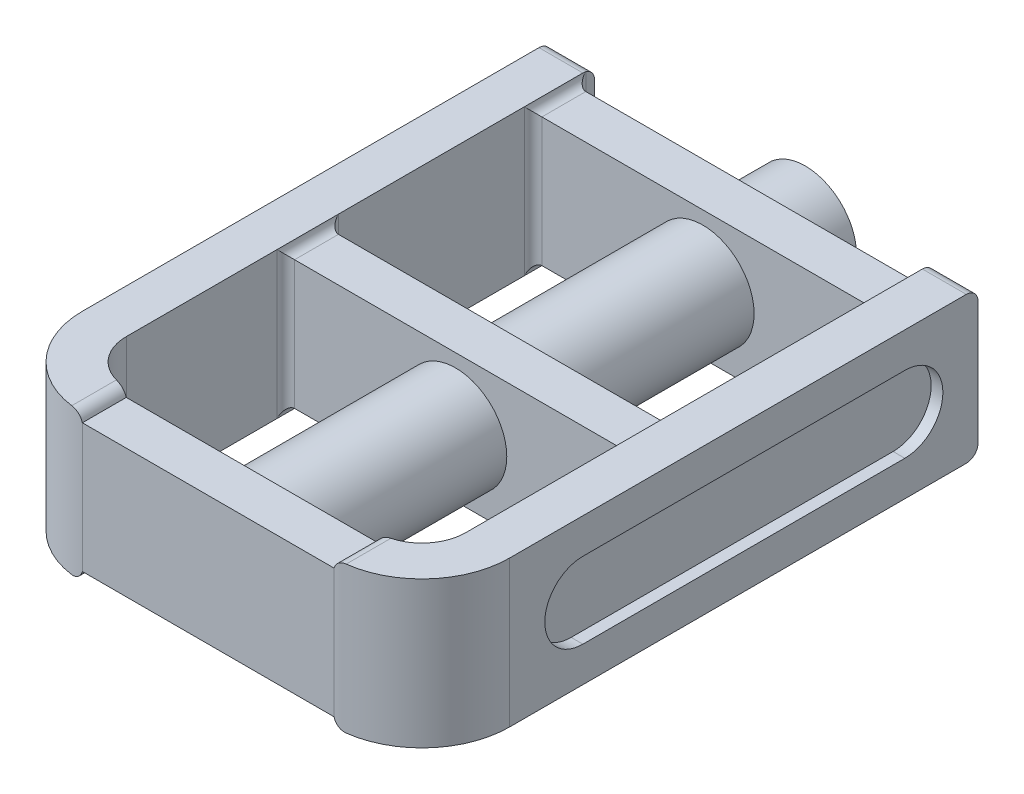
ISO-10303-21;
HEADER;
FILE_DESCRIPTION(('STEP AP214'),'2;1');
FILE_NAME('part.step','',(''),(''),'','','');
FILE_SCHEMA(('AUTOMOTIVE_DESIGN { 1 0 10303 214 1 1 1 1 }'));
ENDSEC;
DATA;
#1=APPLICATION_CONTEXT('core data for automotive mechanical design processes');
#2=APPLICATION_PROTOCOL_DEFINITION('international standard','automotive_design',2000,#1);
#3=PRODUCT_CONTEXT('',#1,'mechanical');
#4=PRODUCT('Part','Part','',(#3));
#5=PRODUCT_RELATED_PRODUCT_CATEGORY('part','',(#4));
#6=PRODUCT_DEFINITION_FORMATION('','',#4);
#7=PRODUCT_DEFINITION_CONTEXT('part definition',#1,'design');
#8=PRODUCT_DEFINITION('design','',#6,#7);
#9=PRODUCT_DEFINITION_SHAPE('','',#8);
#10=(LENGTH_UNIT() NAMED_UNIT(*) SI_UNIT(.MILLI.,.METRE.));
#11=(NAMED_UNIT(*) PLANE_ANGLE_UNIT() SI_UNIT($,.RADIAN.));
#12=(NAMED_UNIT(*) SI_UNIT($,.STERADIAN.) SOLID_ANGLE_UNIT());
#13=UNCERTAINTY_MEASURE_WITH_UNIT(LENGTH_MEASURE(1.E-05),#10,'distance_accuracy_value','');
#14=(GEOMETRIC_REPRESENTATION_CONTEXT(3) GLOBAL_UNCERTAINTY_ASSIGNED_CONTEXT((#13)) GLOBAL_UNIT_ASSIGNED_CONTEXT((#10,
#11,#12)) REPRESENTATION_CONTEXT('',''));
#15=CARTESIAN_POINT('',(0.,0.,0.));
#16=DIRECTION('',(0.,0.,1.));
#17=DIRECTION('',(1.,0.,0.));
#18=AXIS2_PLACEMENT_3D('',#15,#16,#17);
#19=CARTESIAN_POINT('',(29.,12.5,-38.5));
#20=DIRECTION('',(-1.,0.,0.));
#21=DIRECTION('',(0.,0.,1.));
#22=AXIS2_PLACEMENT_3D('',#19,#20,#21);
#23=PLANE('',#22);
#24=DIRECTION('',(0.,0.,-1.));
#25=VECTOR('',#24,1.);
#26=CARTESIAN_POINT('',(29.,-12.5,-38.5));
#27=LINE('',#26,#25);
#28=CARTESIAN_POINT('',(29.,-12.5,-5.25));
#29=VERTEX_POINT('',#28);
#30=CARTESIAN_POINT('',(29.,-12.5,-37.));
#31=VERTEX_POINT('',#30);
#32=EDGE_CURVE('E1857',#29,#31,#27,.T.);
#33=ORIENTED_EDGE('',*,*,#32,.F.);
#34=DIRECTION('',(0.,-1.,0.));
#35=VECTOR('',#34,1.);
#36=CARTESIAN_POINT('',(29.,11.,-5.25000000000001));
#37=LINE('',#36,#35);
#38=CARTESIAN_POINT('',(29.,12.5,-5.25));
#39=VERTEX_POINT('',#38);
#40=EDGE_CURVE('E778',#29,#39,#37,.F.);
#41=ORIENTED_EDGE('',*,*,#40,.T.);
#42=DIRECTION('',(0.,0.,-1.));
#43=VECTOR('',#42,1.);
#44=CARTESIAN_POINT('',(29.,12.5,-38.5));
#45=LINE('',#44,#43);
#46=CARTESIAN_POINT('',(29.,12.5,-37.));
#47=VERTEX_POINT('',#46);
#48=EDGE_CURVE('E1858',#39,#47,#45,.T.);
#49=ORIENTED_EDGE('',*,*,#48,.T.);
#50=DIRECTION('',(0.,-1.,0.));
#51=VECTOR('',#50,1.);
#52=CARTESIAN_POINT('',(29.,-11.,-37.));
#53=LINE('',#52,#51);
#54=EDGE_CURVE('E779',#47,#31,#53,.T.);
#55=ORIENTED_EDGE('',*,*,#54,.T.);
#56=EDGE_LOOP('',(#33,#41,#49,#55));
#57=FACE_BOUND('',#56,.T.);
#58=ADVANCED_FACE('F37',(#57),#23,.T.);
#59=CARTESIAN_POINT('',(29.,-10.5,-47.));
#60=DIRECTION('',(-1.,0.,0.));
#61=DIRECTION('',(0.,0.,1.));
#62=AXIS2_PLACEMENT_3D('',#59,#60,#61);
#63=CIRCLE('',#62,2.);
#64=CARTESIAN_POINT('',(29.,-10.5,-49.));
#65=VERTEX_POINT('',#64);
#66=CARTESIAN_POINT('',(29.,-12.4364916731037,-47.5));
#67=VERTEX_POINT('',#66);
#68=EDGE_CURVE('E582',#65,#67,#63,.T.);
#69=ORIENTED_EDGE('',*,*,#68,.T.);
#70=DIRECTION('',(0.,1.,0.));
#71=VECTOR('',#70,1.);
#72=CARTESIAN_POINT('',(29.,12.5,-47.5));
#73=LINE('',#72,#71);
#74=CARTESIAN_POINT('',(29.,12.4364916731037,-47.5));
#75=VERTEX_POINT('',#74);
#76=EDGE_CURVE('E781',#67,#75,#73,.T.);
#77=ORIENTED_EDGE('',*,*,#76,.T.);
#78=CARTESIAN_POINT('',(29.,10.5,-47.));
#79=DIRECTION('',(-1.,0.,0.));
#80=DIRECTION('',(0.,0.,1.));
#81=AXIS2_PLACEMENT_3D('',#78,#79,#80);
#82=CIRCLE('',#81,2.);
#83=CARTESIAN_POINT('',(29.,10.5,-49.));
#84=VERTEX_POINT('',#83);
#85=EDGE_CURVE('E580',#75,#84,#82,.T.);
#86=ORIENTED_EDGE('',*,*,#85,.T.);
#87=DIRECTION('',(0.,1.,0.));
#88=VECTOR('',#87,1.);
#89=CARTESIAN_POINT('',(29.,12.5,-49.));
#90=LINE('',#89,#88);
#91=EDGE_CURVE('E464',#65,#84,#90,.T.);
#92=ORIENTED_EDGE('',*,*,#91,.F.);
#93=EDGE_LOOP('',(#69,#77,#86,#92));
#94=FACE_BOUND('',#93,.T.);
#95=ADVANCED_FACE('F734',(#94),#23,.T.);
#96=CARTESIAN_POINT('',(-29.,12.5,-38.5));
#97=DIRECTION('',(1.,0.,0.));
#98=DIRECTION('',(0.,0.,-1.));
#99=AXIS2_PLACEMENT_3D('',#96,#97,#98);
#100=PLANE('',#99);
#101=DIRECTION('',(0.,0.,1.));
#102=VECTOR('',#101,1.);
#103=CARTESIAN_POINT('',(-29.,-12.5,-38.5));
#104=LINE('',#103,#102);
#105=CARTESIAN_POINT('',(-29.,-12.5,5.25));
#106=VERTEX_POINT('',#105);
#107=CARTESIAN_POINT('',(-29.,-12.5,30.9999999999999));
#108=VERTEX_POINT('',#107);
#109=EDGE_CURVE('E502',#106,#108,#104,.T.);
#110=ORIENTED_EDGE('',*,*,#109,.F.);
#111=DIRECTION('',(0.,-1.,0.));
#112=VECTOR('',#111,1.);
#113=CARTESIAN_POINT('',(-29.,11.,5.25));
#114=LINE('',#113,#112);
#115=CARTESIAN_POINT('',(-29.,12.5,5.25));
#116=VERTEX_POINT('',#115);
#117=EDGE_CURVE('E911',#106,#116,#114,.F.);
#118=ORIENTED_EDGE('',*,*,#117,.T.);
#119=DIRECTION('',(0.,0.,1.));
#120=VECTOR('',#119,1.);
#121=CARTESIAN_POINT('',(-29.,12.5,-38.5));
#122=LINE('',#121,#120);
#123=CARTESIAN_POINT('',(-29.,12.5,30.9999999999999));
#124=VERTEX_POINT('',#123);
#125=EDGE_CURVE('E508',#116,#124,#122,.T.);
#126=ORIENTED_EDGE('',*,*,#125,.T.);
#127=DIRECTION('',(0.,-1.,0.));
#128=VECTOR('',#127,1.);
#129=CARTESIAN_POINT('',(-29.,12.5,30.9999999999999));
#130=LINE('',#129,#128);
#131=EDGE_CURVE('E487',#124,#108,#130,.T.);
#132=ORIENTED_EDGE('',*,*,#131,.T.);
#133=EDGE_LOOP('',(#110,#118,#126,#132));
#134=FACE_BOUND('',#133,.T.);
#135=ADVANCED_FACE('F741',(#134),#100,.T.);
#136=CARTESIAN_POINT('',(-29.,-12.5,-37.));
#137=VERTEX_POINT('',#136);
#138=CARTESIAN_POINT('',(-29.,-12.5,-5.25));
#139=VERTEX_POINT('',#138);
#140=EDGE_CURVE('E518',#137,#139,#104,.T.);
#141=ORIENTED_EDGE('',*,*,#140,.F.);
#142=DIRECTION('',(0.,-1.,0.));
#143=VECTOR('',#142,1.);
#144=CARTESIAN_POINT('',(-29.,11.,-37.));
#145=LINE('',#144,#143);
#146=CARTESIAN_POINT('',(-29.,12.5,-37.));
#147=VERTEX_POINT('',#146);
#148=EDGE_CURVE('E913',#137,#147,#145,.F.);
#149=ORIENTED_EDGE('',*,*,#148,.T.);
#150=CARTESIAN_POINT('',(-29.,12.5,-5.25));
#151=VERTEX_POINT('',#150);
#152=EDGE_CURVE('E507',#147,#151,#122,.T.);
#153=ORIENTED_EDGE('',*,*,#152,.T.);
#154=DIRECTION('',(0.,-1.,0.));
#155=VECTOR('',#154,1.);
#156=CARTESIAN_POINT('',(-29.,-11.,-5.25));
#157=LINE('',#156,#155);
#158=EDGE_CURVE('E915',#151,#139,#157,.T.);
#159=ORIENTED_EDGE('',*,*,#158,.T.);
#160=EDGE_LOOP('',(#141,#149,#153,#159));
#161=FACE_BOUND('',#160,.T.);
#162=ADVANCED_FACE('F758',(#161),#100,.T.);
#163=CARTESIAN_POINT('',(36.5,12.5,-46.));
#164=DIRECTION('',(-1.,0.,0.));
#165=DIRECTION('',(0.,0.,1.));
#166=AXIS2_PLACEMENT_3D('',#163,#164,#165);
#167=PLANE('',#166);
#168=DIRECTION('',(0.,0.,-1.));
#169=VECTOR('',#168,1.);
#170=CARTESIAN_POINT('',(36.5,-12.5,-46.));
#171=LINE('',#170,#169);
#172=CARTESIAN_POINT('',(36.5,-12.5,30.9999999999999));
#173=VERTEX_POINT('',#172);
#174=CARTESIAN_POINT('',(36.5,-12.5,-47.));
#175=VERTEX_POINT('',#174);
#176=EDGE_CURVE('E526',#173,#175,#171,.T.);
#177=ORIENTED_EDGE('',*,*,#176,.T.);
#178=CARTESIAN_POINT('',(36.5,-10.5,-47.));
#179=DIRECTION('',(-1.,0.,0.));
#180=DIRECTION('',(0.,0.,1.));
#181=AXIS2_PLACEMENT_3D('',#178,#179,#180);
#182=CIRCLE('',#181,2.);
#183=CARTESIAN_POINT('',(36.5,-10.5,-49.));
#184=VERTEX_POINT('',#183);
#185=EDGE_CURVE('E589',#175,#184,#182,.F.);
#186=ORIENTED_EDGE('',*,*,#185,.T.);
#187=DIRECTION('',(0.,-1.,0.));
#188=VECTOR('',#187,1.);
#189=CARTESIAN_POINT('',(36.5,12.5,-49.));
#190=LINE('',#189,#188);
#191=CARTESIAN_POINT('',(36.5,10.5,-49.));
#192=VERTEX_POINT('',#191);
#193=EDGE_CURVE('E461',#192,#184,#190,.T.);
#194=ORIENTED_EDGE('',*,*,#193,.F.);
#195=CARTESIAN_POINT('',(36.5,10.5,-47.));
#196=DIRECTION('',(-1.,0.,0.));
#197=DIRECTION('',(0.,0.,1.));
#198=AXIS2_PLACEMENT_3D('',#195,#196,#197);
#199=CIRCLE('',#198,2.);
#200=CARTESIAN_POINT('',(36.5,12.5,-47.));
#201=VERTEX_POINT('',#200);
#202=EDGE_CURVE('E587',#192,#201,#199,.F.);
#203=ORIENTED_EDGE('',*,*,#202,.T.);
#204=DIRECTION('',(0.,0.,-1.));
#205=VECTOR('',#204,1.);
#206=CARTESIAN_POINT('',(36.5,12.5,-46.));
#207=LINE('',#206,#205);
#208=CARTESIAN_POINT('',(36.5,12.5,30.9999999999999));
#209=VERTEX_POINT('',#208);
#210=EDGE_CURVE('E531',#209,#201,#207,.T.);
#211=ORIENTED_EDGE('',*,*,#210,.F.);
#212=DIRECTION('',(0.,-1.,0.));
#213=VECTOR('',#212,1.);
#214=CARTESIAN_POINT('',(36.5,12.5,30.9999999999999));
#215=LINE('',#214,#213);
#216=EDGE_CURVE('E534',#209,#173,#215,.T.);
#217=ORIENTED_EDGE('',*,*,#216,.T.);
#218=EDGE_LOOP('',(#177,#186,#194,#203,#211,#217));
#219=FACE_BOUND('',#218,.T.);
#220=CARTESIAN_POINT('',(36.5,0.,-36.5));
#221=DIRECTION('',(-1.,0.,0.));
#222=DIRECTION('',(0.,0.,1.));
#223=AXIS2_PLACEMENT_3D('',#220,#221,#222);
#224=CIRCLE('',#223,6.5);
#225=CARTESIAN_POINT('',(36.5,6.5,-36.5));
#226=VERTEX_POINT('',#225);
#227=CARTESIAN_POINT('',(36.5,-6.5,-36.5));
#228=VERTEX_POINT('',#227);
#229=EDGE_CURVE('E352',#226,#228,#224,.T.);
#230=ORIENTED_EDGE('',*,*,#229,.T.);
#231=DIRECTION('',(0.,0.,1.));
#232=VECTOR('',#231,1.);
#233=CARTESIAN_POINT('',(36.5,-6.5,-36.5));
#234=LINE('',#233,#232);
#235=CARTESIAN_POINT('',(36.5,-6.49999999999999,18.5));
#236=VERTEX_POINT('',#235);
#237=EDGE_CURVE('E356',#228,#236,#234,.T.);
#238=ORIENTED_EDGE('',*,*,#237,.T.);
#239=CARTESIAN_POINT('',(36.5,0.,18.5));
#240=DIRECTION('',(-1.,0.,0.));
#241=DIRECTION('',(0.,0.,1.));
#242=AXIS2_PLACEMENT_3D('',#239,#240,#241);
#243=CIRCLE('',#242,6.5);
#244=CARTESIAN_POINT('',(36.5,6.50000000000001,18.5));
#245=VERTEX_POINT('',#244);
#246=EDGE_CURVE('E359',#236,#245,#243,.T.);
#247=ORIENTED_EDGE('',*,*,#246,.T.);
#248=DIRECTION('',(0.,0.,-1.));
#249=VECTOR('',#248,1.);
#250=CARTESIAN_POINT('',(36.5,6.5,-36.5));
#251=LINE('',#250,#249);
#252=EDGE_CURVE('E365',#245,#226,#251,.T.);
#253=ORIENTED_EDGE('',*,*,#252,.T.);
#254=EDGE_LOOP('',(#230,#238,#247,#253));
#255=FACE_BOUND('',#254,.T.);
#256=ADVANCED_FACE('F941',(#219,#255),#167,.F.);
#257=CARTESIAN_POINT('',(-36.5,12.5,-46.));
#258=DIRECTION('',(0.,0.,1.));
#259=DIRECTION('',(1.,0.,0.));
#260=AXIS2_PLACEMENT_3D('',#257,#258,#259);
#261=PLANE('',#260);
#262=CARTESIAN_POINT('',(0.,0.,-46.));
#263=DIRECTION('',(0.,0.,1.));
#264=DIRECTION('',(1.,0.,0.));
#265=AXIS2_PLACEMENT_3D('',#262,#263,#264);
#266=CIRCLE('',#265,10.75);
#267=CARTESIAN_POINT('',(10.75,0.,-46.));
#268=VERTEX_POINT('',#267);
#269=EDGE_CURVE('E571',#268,#268,#266,.T.);
#270=ORIENTED_EDGE('',*,*,#269,.T.);
#271=EDGE_LOOP('',(#270));
#272=FACE_BOUND('',#271,.T.);
#273=DIRECTION('',(-1.,0.,0.));
#274=VECTOR('',#273,1.);
#275=CARTESIAN_POINT('',(-29.,11.,-46.));
#276=LINE('',#275,#274);
#277=CARTESIAN_POINT('',(27.5,11.,-46.));
#278=VERTEX_POINT('',#277);
#279=CARTESIAN_POINT('',(-27.5,11.,-46.));
#280=VERTEX_POINT('',#279);
#281=EDGE_CURVE('E435',#278,#280,#276,.T.);
#282=ORIENTED_EDGE('',*,*,#281,.F.);
#283=DIRECTION('',(0.,1.,0.));
#284=VECTOR('',#283,1.);
#285=CARTESIAN_POINT('',(27.5,12.5,-46.));
#286=LINE('',#285,#284);
#287=CARTESIAN_POINT('',(27.5,-11.,-46.));
#288=VERTEX_POINT('',#287);
#289=EDGE_CURVE('E790',#278,#288,#286,.F.);
#290=ORIENTED_EDGE('',*,*,#289,.T.);
#291=DIRECTION('',(-1.,0.,0.));
#292=VECTOR('',#291,1.);
#293=CARTESIAN_POINT('',(-29.,-11.,-46.));
#294=LINE('',#293,#292);
#295=CARTESIAN_POINT('',(-27.5,-11.,-46.));
#296=VERTEX_POINT('',#295);
#297=EDGE_CURVE('E408',#288,#296,#294,.T.);
#298=ORIENTED_EDGE('',*,*,#297,.T.);
#299=DIRECTION('',(0.,-1.,0.));
#300=VECTOR('',#299,1.);
#301=CARTESIAN_POINT('',(-27.5,12.5,-46.));
#302=LINE('',#301,#300);
#303=EDGE_CURVE('E788',#296,#280,#302,.F.);
#304=ORIENTED_EDGE('',*,*,#303,.T.);
#305=EDGE_LOOP('',(#282,#290,#298,#304));
#306=FACE_BOUND('',#305,.T.);
#307=ADVANCED_FACE('F945',(#272,#306),#261,.F.);
#308=CARTESIAN_POINT('',(-21.4999999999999,12.5,46.));
#309=DIRECTION('',(0.,0.,-1.));
#310=DIRECTION('',(-1.,0.,0.));
#311=AXIS2_PLACEMENT_3D('',#308,#309,#310);
#312=PLANE('',#311);
#313=DIRECTION('',(1.,0.,0.));
#314=VECTOR('',#313,1.);
#315=CARTESIAN_POINT('',(-21.4999999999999,-11.,46.));
#316=LINE('',#315,#314);
#317=CARTESIAN_POINT('',(-21.4999999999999,-11.,46.));
#318=VERTEX_POINT('',#317);
#319=CARTESIAN_POINT('',(21.4999999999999,-11.,46.));
#320=VERTEX_POINT('',#319);
#321=EDGE_CURVE('E419',#318,#320,#316,.T.);
#322=ORIENTED_EDGE('',*,*,#321,.T.);
#323=DIRECTION('',(0.,-1.,0.));
#324=VECTOR('',#323,1.);
#325=CARTESIAN_POINT('',(21.4999999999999,12.5,46.));
#326=LINE('',#325,#324);
#327=CARTESIAN_POINT('',(21.4999999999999,11.,46.));
#328=VERTEX_POINT('',#327);
#329=EDGE_CURVE('E545',#328,#320,#326,.T.);
#330=ORIENTED_EDGE('',*,*,#329,.F.);
#331=DIRECTION('',(1.,0.,0.));
#332=VECTOR('',#331,1.);
#333=CARTESIAN_POINT('',(-21.4999999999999,11.,46.));
#334=LINE('',#333,#332);
#335=CARTESIAN_POINT('',(-21.4999999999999,11.,46.));
#336=VERTEX_POINT('',#335);
#337=EDGE_CURVE('E448',#336,#328,#334,.T.);
#338=ORIENTED_EDGE('',*,*,#337,.F.);
#339=DIRECTION('',(0.,-1.,0.));
#340=VECTOR('',#339,1.);
#341=CARTESIAN_POINT('',(-21.4999999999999,12.5,46.));
#342=LINE('',#341,#340);
#343=EDGE_CURVE('E548',#336,#318,#342,.T.);
#344=ORIENTED_EDGE('',*,*,#343,.T.);
#345=EDGE_LOOP('',(#322,#330,#338,#344));
#346=FACE_BOUND('',#345,.T.);
#347=ADVANCED_FACE('F644',(#346),#312,.F.);
#348=CARTESIAN_POINT('',(-29.,12.5,-38.5));
#349=DIRECTION('',(0.,0.,1.));
#350=DIRECTION('',(1.,0.,0.));
#351=AXIS2_PLACEMENT_3D('',#348,#349,#350);
#352=PLANE('',#351);
#353=CARTESIAN_POINT('',(0.,0.,-38.5));
#354=DIRECTION('',(0.,0.,1.));
#355=DIRECTION('',(1.,0.,0.));
#356=AXIS2_PLACEMENT_3D('',#353,#354,#355);
#357=CIRCLE('',#356,8.75);
#358=CARTESIAN_POINT('',(8.75,0.,-38.5));
#359=VERTEX_POINT('',#358);
#360=EDGE_CURVE('E477',#359,#359,#357,.F.);
#361=ORIENTED_EDGE('',*,*,#360,.T.);
#362=EDGE_LOOP('',(#361));
#363=FACE_BOUND('',#362,.T.);
#364=DIRECTION('',(1.,0.,0.));
#365=VECTOR('',#364,1.);
#366=CARTESIAN_POINT('',(-29.,-11.,-38.5));
#367=LINE('',#366,#365);
#368=CARTESIAN_POINT('',(-27.5,-11.,-38.5));
#369=VERTEX_POINT('',#368);
#370=CARTESIAN_POINT('',(27.5,-11.,-38.5));
#371=VERTEX_POINT('',#370);
#372=EDGE_CURVE('E411',#369,#371,#367,.T.);
#373=ORIENTED_EDGE('',*,*,#372,.T.);
#374=DIRECTION('',(0.,-1.,0.));
#375=VECTOR('',#374,1.);
#376=CARTESIAN_POINT('',(27.5,11.,-38.5));
#377=LINE('',#376,#375);
#378=CARTESIAN_POINT('',(27.5,11.,-38.5));
#379=VERTEX_POINT('',#378);
#380=EDGE_CURVE('E805',#371,#379,#377,.F.);
#381=ORIENTED_EDGE('',*,*,#380,.T.);
#382=DIRECTION('',(1.,0.,0.));
#383=VECTOR('',#382,1.);
#384=CARTESIAN_POINT('',(-29.,11.,-38.5));
#385=LINE('',#384,#383);
#386=CARTESIAN_POINT('',(-27.5,11.,-38.5));
#387=VERTEX_POINT('',#386);
#388=EDGE_CURVE('E432',#387,#379,#385,.T.);
#389=ORIENTED_EDGE('',*,*,#388,.F.);
#390=DIRECTION('',(0.,-1.,0.));
#391=VECTOR('',#390,1.);
#392=CARTESIAN_POINT('',(-27.5,-11.,-38.5));
#393=LINE('',#392,#391);
#394=EDGE_CURVE('E803',#387,#369,#393,.T.);
#395=ORIENTED_EDGE('',*,*,#394,.T.);
#396=EDGE_LOOP('',(#373,#381,#389,#395));
#397=FACE_BOUND('',#396,.T.);
#398=ADVANCED_FACE('F959',(#363,#397),#352,.T.);
#399=CARTESIAN_POINT('',(-29.,12.5,-3.75));
#400=DIRECTION('',(0.,0.,-1.));
#401=DIRECTION('',(-1.,0.,0.));
#402=AXIS2_PLACEMENT_3D('',#399,#400,#401);
#403=PLANE('',#402);
#404=CARTESIAN_POINT('',(0.,0.,-3.75));
#405=DIRECTION('',(0.,0.,-1.));
#406=DIRECTION('',(-1.,0.,0.));
#407=AXIS2_PLACEMENT_3D('',#404,#405,#406);
#408=CIRCLE('',#407,10.75);
#409=CARTESIAN_POINT('',(-10.75,0.,-3.75));
#410=VERTEX_POINT('',#409);
#411=EDGE_CURVE('E562',#410,#410,#408,.F.);
#412=ORIENTED_EDGE('',*,*,#411,.T.);
#413=EDGE_LOOP('',(#412));
#414=FACE_BOUND('',#413,.T.);
#415=DIRECTION('',(-1.,0.,0.));
#416=VECTOR('',#415,1.);
#417=CARTESIAN_POINT('',(-29.,11.,-3.75));
#418=LINE('',#417,#416);
#419=CARTESIAN_POINT('',(27.5,11.,-3.75));
#420=VERTEX_POINT('',#419);
#421=CARTESIAN_POINT('',(-27.5,11.,-3.75));
#422=VERTEX_POINT('',#421);
#423=EDGE_CURVE('E436',#420,#422,#418,.T.);
#424=ORIENTED_EDGE('',*,*,#423,.F.);
#425=DIRECTION('',(0.,-1.,0.));
#426=VECTOR('',#425,1.);
#427=CARTESIAN_POINT('',(27.5,-11.,-3.75000000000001));
#428=LINE('',#427,#426);
#429=CARTESIAN_POINT('',(27.5,-11.,-3.75));
#430=VERTEX_POINT('',#429);
#431=EDGE_CURVE('E794',#420,#430,#428,.T.);
#432=ORIENTED_EDGE('',*,*,#431,.T.);
#433=DIRECTION('',(-1.,0.,0.));
#434=VECTOR('',#433,1.);
#435=CARTESIAN_POINT('',(-29.,-11.,-3.75));
#436=LINE('',#435,#434);
#437=CARTESIAN_POINT('',(-27.5,-11.,-3.75));
#438=VERTEX_POINT('',#437);
#439=EDGE_CURVE('E416',#430,#438,#436,.T.);
#440=ORIENTED_EDGE('',*,*,#439,.T.);
#441=DIRECTION('',(0.,-1.,0.));
#442=VECTOR('',#441,1.);
#443=CARTESIAN_POINT('',(-27.5,11.,-3.75));
#444=LINE('',#443,#442);
#445=EDGE_CURVE('E792',#438,#422,#444,.F.);
#446=ORIENTED_EDGE('',*,*,#445,.T.);
#447=EDGE_LOOP('',(#424,#432,#440,#446));
#448=FACE_BOUND('',#447,.T.);
#449=ADVANCED_FACE('F894',(#414,#448),#403,.T.);
#450=CARTESIAN_POINT('',(-21.4999999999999,12.5,38.5));
#451=DIRECTION('',(0.,0.,-1.));
#452=DIRECTION('',(-1.,0.,0.));
#453=AXIS2_PLACEMENT_3D('',#450,#451,#452);
#454=PLANE('',#453);
#455=CARTESIAN_POINT('',(0.,0.,38.5));
#456=DIRECTION('',(0.,0.,-1.));
#457=DIRECTION('',(-1.,0.,0.));
#458=AXIS2_PLACEMENT_3D('',#455,#456,#457);
#459=CIRCLE('',#458,10.75);
#460=CARTESIAN_POINT('',(-10.75,0.,38.5));
#461=VERTEX_POINT('',#460);
#462=EDGE_CURVE('E554',#461,#461,#459,.F.);
#463=ORIENTED_EDGE('',*,*,#462,.T.);
#464=EDGE_LOOP('',(#463));
#465=FACE_BOUND('',#464,.T.);
#466=DIRECTION('',(0.,-1.,0.));
#467=VECTOR('',#466,1.);
#468=CARTESIAN_POINT('',(21.4999999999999,12.5,38.5));
#469=LINE('',#468,#467);
#470=CARTESIAN_POINT('',(21.4999999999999,11.,38.5));
#471=VERTEX_POINT('',#470);
#472=CARTESIAN_POINT('',(21.4999999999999,-11.,38.5));
#473=VERTEX_POINT('',#472);
#474=EDGE_CURVE('E496',#471,#473,#469,.T.);
#475=ORIENTED_EDGE('',*,*,#474,.T.);
#476=DIRECTION('',(-1.,0.,0.));
#477=VECTOR('',#476,1.);
#478=CARTESIAN_POINT('',(-21.4999999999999,-11.,38.5));
#479=LINE('',#478,#477);
#480=CARTESIAN_POINT('',(-21.4999999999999,-11.,38.5));
#481=VERTEX_POINT('',#480);
#482=EDGE_CURVE('E424',#473,#481,#479,.T.);
#483=ORIENTED_EDGE('',*,*,#482,.T.);
#484=DIRECTION('',(0.,-1.,0.));
#485=VECTOR('',#484,1.);
#486=CARTESIAN_POINT('',(-21.4999999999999,12.5,38.5));
#487=LINE('',#486,#485);
#488=CARTESIAN_POINT('',(-21.4999999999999,11.,38.5));
#489=VERTEX_POINT('',#488);
#490=EDGE_CURVE('E499',#489,#481,#487,.T.);
#491=ORIENTED_EDGE('',*,*,#490,.F.);
#492=DIRECTION('',(-1.,0.,0.));
#493=VECTOR('',#492,1.);
#494=CARTESIAN_POINT('',(-21.4999999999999,11.,38.5));
#495=LINE('',#494,#493);
#496=EDGE_CURVE('E443',#471,#489,#495,.T.);
#497=ORIENTED_EDGE('',*,*,#496,.F.);
#498=EDGE_LOOP('',(#475,#483,#491,#497));
#499=FACE_BOUND('',#498,.T.);
#500=ADVANCED_FACE('F963',(#465,#499),#454,.T.);
#501=CARTESIAN_POINT('',(-29.,12.5,3.75));
#502=DIRECTION('',(0.,0.,1.));
#503=DIRECTION('',(1.,0.,0.));
#504=AXIS2_PLACEMENT_3D('',#501,#502,#503);
#505=PLANE('',#504);
#506=CARTESIAN_POINT('',(0.,0.,3.74999999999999));
#507=DIRECTION('',(0.,0.,1.));
#508=DIRECTION('',(1.,0.,0.));
#509=AXIS2_PLACEMENT_3D('',#506,#507,#508);
#510=CIRCLE('',#509,8.75);
#511=CARTESIAN_POINT('',(8.75,0.,3.74999999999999));
#512=VERTEX_POINT('',#511);
#513=EDGE_CURVE('E476',#512,#512,#510,.F.);
#514=ORIENTED_EDGE('',*,*,#513,.T.);
#515=EDGE_LOOP('',(#514));
#516=FACE_BOUND('',#515,.T.);
#517=DIRECTION('',(1.,0.,0.));
#518=VECTOR('',#517,1.);
#519=CARTESIAN_POINT('',(-29.,-11.,3.74999999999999));
#520=LINE('',#519,#518);
#521=CARTESIAN_POINT('',(-27.5,-11.,3.74999999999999));
#522=VERTEX_POINT('',#521);
#523=CARTESIAN_POINT('',(27.5,-11.,3.74999999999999));
#524=VERTEX_POINT('',#523);
#525=EDGE_CURVE('E412',#522,#524,#520,.T.);
#526=ORIENTED_EDGE('',*,*,#525,.T.);
#527=DIRECTION('',(0.,-1.,0.));
#528=VECTOR('',#527,1.);
#529=CARTESIAN_POINT('',(27.5,11.,3.74999999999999));
#530=LINE('',#529,#528);
#531=CARTESIAN_POINT('',(27.5,11.,3.74999999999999));
#532=VERTEX_POINT('',#531);
#533=EDGE_CURVE('E798',#524,#532,#530,.F.);
#534=ORIENTED_EDGE('',*,*,#533,.T.);
#535=DIRECTION('',(1.,0.,0.));
#536=VECTOR('',#535,1.);
#537=CARTESIAN_POINT('',(-29.,11.,3.74999999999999));
#538=LINE('',#537,#536);
#539=CARTESIAN_POINT('',(-27.5,11.,3.74999999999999));
#540=VERTEX_POINT('',#539);
#541=EDGE_CURVE('E440',#540,#532,#538,.T.);
#542=ORIENTED_EDGE('',*,*,#541,.F.);
#543=DIRECTION('',(0.,-1.,0.));
#544=VECTOR('',#543,1.);
#545=CARTESIAN_POINT('',(-27.5,-11.,3.75));
#546=LINE('',#545,#544);
#547=EDGE_CURVE('E796',#540,#522,#546,.T.);
#548=ORIENTED_EDGE('',*,*,#547,.T.);
#549=EDGE_LOOP('',(#526,#534,#542,#548));
#550=FACE_BOUND('',#549,.T.);
#551=ADVANCED_FACE('F954',(#516,#550),#505,.T.);
#552=CARTESIAN_POINT('',(-21.5,-12.5,31.));
#553=DIRECTION('',(0.,1.,0.));
#554=DIRECTION('',(0.,0.,1.));
#555=AXIS2_PLACEMENT_3D('',#552,#553,#554);
#556=PLANE('',#555);
#557=CARTESIAN_POINT('',(-21.5,-12.5,31.));
#558=DIRECTION('',(0.,1.,0.));
#559=DIRECTION('',(0.,0.,1.));
#560=AXIS2_PLACEMENT_3D('',#557,#558,#559);
#561=CIRCLE('',#560,7.5);
#562=CARTESIAN_POINT('',(-23.4364916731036,-12.5,38.2456883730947));
#563=VERTEX_POINT('',#562);
#564=EDGE_CURVE('E480',#108,#563,#561,.T.);
#565=ORIENTED_EDGE('',*,*,#564,.T.);
#566=DIRECTION('',(0.,0.,-1.));
#567=VECTOR('',#566,1.);
#568=CARTESIAN_POINT('',(-23.4364916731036,-12.5,31.));
#569=LINE('',#568,#567);
#570=CARTESIAN_POINT('',(-23.4364916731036,-12.5,45.8744747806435));
#571=VERTEX_POINT('',#570);
#572=EDGE_CURVE('E614',#563,#571,#569,.F.);
#573=ORIENTED_EDGE('',*,*,#572,.T.);
#574=CARTESIAN_POINT('',(-21.5,-12.5,31.));
#575=DIRECTION('',(0.,1.,0.));
#576=DIRECTION('',(0.,0.,1.));
#577=AXIS2_PLACEMENT_3D('',#574,#575,#576);
#578=CIRCLE('',#577,15.);
#579=CARTESIAN_POINT('',(-36.5,-12.5,30.9999999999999));
#580=VERTEX_POINT('',#579);
#581=EDGE_CURVE('E536',#580,#571,#578,.T.);
#582=ORIENTED_EDGE('',*,*,#581,.F.);
#583=DIRECTION('',(0.,0.,1.));
#584=VECTOR('',#583,1.);
#585=CARTESIAN_POINT('',(-36.5,-12.5,-46.));
#586=LINE('',#585,#584);
#587=CARTESIAN_POINT('',(-36.5,-12.5,-47.));
#588=VERTEX_POINT('',#587);
#589=EDGE_CURVE('E512',#588,#580,#586,.T.);
#590=ORIENTED_EDGE('',*,*,#589,.F.);
#591=DIRECTION('',(-1.,0.,0.));
#592=VECTOR('',#591,1.);
#593=CARTESIAN_POINT('',(-21.5,-12.5,-47.));
#594=LINE('',#593,#592);
#595=CARTESIAN_POINT('',(-29.,-12.5,-47.));
#596=VERTEX_POINT('',#595);
#597=EDGE_CURVE('E604',#588,#596,#594,.F.);
#598=ORIENTED_EDGE('',*,*,#597,.T.);
#599=EDGE_CURVE('E514',#596,#137,#104,.T.);
#600=ORIENTED_EDGE('',*,*,#599,.T.);
#601=ORIENTED_EDGE('',*,*,#140,.T.);
#602=EDGE_CURVE('E1016',#139,#106,#104,.T.);
#603=ORIENTED_EDGE('',*,*,#602,.T.);
#604=ORIENTED_EDGE('',*,*,#109,.T.);
#605=EDGE_LOOP('',(#565,#573,#582,#590,#598,#600,#601,#603,#604));
#606=FACE_BOUND('',#605,.T.);
#607=ADVANCED_FACE('F950',(#606),#556,.F.);
#608=CARTESIAN_POINT('',(21.5,-12.5,31.));
#609=DIRECTION('',(0.,1.,0.));
#610=DIRECTION('',(0.,0.,1.));
#611=AXIS2_PLACEMENT_3D('',#608,#609,#610);
#612=CIRCLE('',#611,15.);
#613=CARTESIAN_POINT('',(23.4364916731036,-12.5,45.8744747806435));
#614=VERTEX_POINT('',#613);
#615=EDGE_CURVE('E539',#614,#173,#612,.T.);
#616=ORIENTED_EDGE('',*,*,#615,.F.);
#617=DIRECTION('',(0.,0.,1.));
#618=VECTOR('',#617,1.);
#619=CARTESIAN_POINT('',(23.4364916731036,-12.5,31.));
#620=LINE('',#619,#618);
#621=CARTESIAN_POINT('',(23.4364916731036,-12.5,38.2456883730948));
#622=VERTEX_POINT('',#621);
#623=EDGE_CURVE('E994',#614,#622,#620,.F.);
#624=ORIENTED_EDGE('',*,*,#623,.T.);
#625=CARTESIAN_POINT('',(21.5,-12.5,31.));
#626=DIRECTION('',(0.,1.,0.));
#627=DIRECTION('',(0.,0.,1.));
#628=AXIS2_PLACEMENT_3D('',#625,#626,#627);
#629=CIRCLE('',#628,7.5);
#630=CARTESIAN_POINT('',(29.,-12.5,30.9999999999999));
#631=VERTEX_POINT('',#630);
#632=EDGE_CURVE('E485',#622,#631,#629,.T.);
#633=ORIENTED_EDGE('',*,*,#632,.T.);
#634=CARTESIAN_POINT('',(29.,-12.5,5.24999999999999));
#635=VERTEX_POINT('',#634);
#636=EDGE_CURVE('E519',#631,#635,#27,.T.);
#637=ORIENTED_EDGE('',*,*,#636,.T.);
#638=EDGE_CURVE('E522',#635,#29,#27,.T.);
#639=ORIENTED_EDGE('',*,*,#638,.T.);
#640=ORIENTED_EDGE('',*,*,#32,.T.);
#641=CARTESIAN_POINT('',(29.,-12.5,-47.));
#642=VERTEX_POINT('',#641);
#643=EDGE_CURVE('E517',#31,#642,#27,.T.);
#644=ORIENTED_EDGE('',*,*,#643,.T.);
#645=DIRECTION('',(-1.,0.,0.));
#646=VECTOR('',#645,1.);
#647=CARTESIAN_POINT('',(36.5,-12.5,-47.));
#648=LINE('',#647,#646);
#649=EDGE_CURVE('E585',#642,#175,#648,.F.);
#650=ORIENTED_EDGE('',*,*,#649,.T.);
#651=ORIENTED_EDGE('',*,*,#176,.F.);
#652=EDGE_LOOP('',(#616,#624,#633,#637,#639,#640,#644,#650,#651));
#653=FACE_BOUND('',#652,.T.);
#654=ADVANCED_FACE('F953',(#653),#556,.F.);
#655=CARTESIAN_POINT('',(-21.5,12.5,31.));
#656=DIRECTION('',(0.,1.,0.));
#657=DIRECTION('',(0.,0.,1.));
#658=AXIS2_PLACEMENT_3D('',#655,#656,#657);
#659=PLANE('',#658);
#660=CARTESIAN_POINT('',(-21.5,12.5,31.));
#661=DIRECTION('',(0.,1.,0.));
#662=DIRECTION('',(0.,0.,1.));
#663=AXIS2_PLACEMENT_3D('',#660,#661,#662);
#664=CIRCLE('',#663,15.);
#665=CARTESIAN_POINT('',(-36.5,12.5,30.9999999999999));
#666=VERTEX_POINT('',#665);
#667=CARTESIAN_POINT('',(-23.4364916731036,12.5,45.8744747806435));
#668=VERTEX_POINT('',#667);
#669=EDGE_CURVE('E525',#666,#668,#664,.T.);
#670=ORIENTED_EDGE('',*,*,#669,.T.);
#671=DIRECTION('',(0.,0.,1.));
#672=VECTOR('',#671,1.);
#673=CARTESIAN_POINT('',(-23.4364916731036,12.5,38.5));
#674=LINE('',#673,#672);
#675=CARTESIAN_POINT('',(-23.4364916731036,12.5,38.2456883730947));
#676=VERTEX_POINT('',#675);
#677=EDGE_CURVE('E921',#668,#676,#674,.F.);
#678=ORIENTED_EDGE('',*,*,#677,.T.);
#679=CARTESIAN_POINT('',(-21.5,12.5,31.));
#680=DIRECTION('',(0.,1.,0.));
#681=DIRECTION('',(0.,0.,1.));
#682=AXIS2_PLACEMENT_3D('',#679,#680,#681);
#683=CIRCLE('',#682,7.5);
#684=EDGE_CURVE('E481',#124,#676,#683,.T.);
#685=ORIENTED_EDGE('',*,*,#684,.F.);
#686=ORIENTED_EDGE('',*,*,#125,.F.);
#687=EDGE_CURVE('E1038',#151,#116,#122,.T.);
#688=ORIENTED_EDGE('',*,*,#687,.F.);
#689=ORIENTED_EDGE('',*,*,#152,.F.);
#690=CARTESIAN_POINT('',(-29.,12.5,-47.));
#691=VERTEX_POINT('',#690);
#692=EDGE_CURVE('E503',#691,#147,#122,.T.);
#693=ORIENTED_EDGE('',*,*,#692,.F.);
#694=DIRECTION('',(1.,0.,0.));
#695=VECTOR('',#694,1.);
#696=CARTESIAN_POINT('',(-36.5,12.5,-47.));
#697=LINE('',#696,#695);
#698=CARTESIAN_POINT('',(-36.5,12.5,-47.));
#699=VERTEX_POINT('',#698);
#700=EDGE_CURVE('E612',#691,#699,#697,.F.);
#701=ORIENTED_EDGE('',*,*,#700,.T.);
#702=DIRECTION('',(0.,0.,1.));
#703=VECTOR('',#702,1.);
#704=CARTESIAN_POINT('',(-36.5,12.5,-46.));
#705=LINE('',#704,#703);
#706=EDGE_CURVE('E523',#699,#666,#705,.T.);
#707=ORIENTED_EDGE('',*,*,#706,.T.);
#708=EDGE_LOOP('',(#670,#678,#685,#686,#688,#689,#693,#701,#707));
#709=FACE_BOUND('',#708,.T.);
#710=ADVANCED_FACE('F958',(#709),#659,.T.);
#711=CARTESIAN_POINT('',(21.5,12.5,31.));
#712=DIRECTION('',(0.,1.,0.));
#713=DIRECTION('',(0.,0.,1.));
#714=AXIS2_PLACEMENT_3D('',#711,#712,#713);
#715=CIRCLE('',#714,7.5);
#716=CARTESIAN_POINT('',(23.4364916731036,12.5,38.2456883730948));
#717=VERTEX_POINT('',#716);
#718=CARTESIAN_POINT('',(29.,12.5,30.9999999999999));
#719=VERTEX_POINT('',#718);
#720=EDGE_CURVE('E484',#717,#719,#715,.T.);
#721=ORIENTED_EDGE('',*,*,#720,.F.);
#722=DIRECTION('',(0.,0.,-1.));
#723=VECTOR('',#722,1.);
#724=CARTESIAN_POINT('',(23.4364916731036,12.5,46.));
#725=LINE('',#724,#723);
#726=CARTESIAN_POINT('',(23.4364916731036,12.5,45.8744747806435));
#727=VERTEX_POINT('',#726);
#728=EDGE_CURVE('E919',#717,#727,#725,.F.);
#729=ORIENTED_EDGE('',*,*,#728,.T.);
#730=CARTESIAN_POINT('',(21.5,12.5,31.));
#731=DIRECTION('',(0.,1.,0.));
#732=DIRECTION('',(0.,0.,1.));
#733=AXIS2_PLACEMENT_3D('',#730,#731,#732);
#734=CIRCLE('',#733,15.);
#735=EDGE_CURVE('E529',#727,#209,#734,.T.);
#736=ORIENTED_EDGE('',*,*,#735,.T.);
#737=ORIENTED_EDGE('',*,*,#210,.T.);
#738=DIRECTION('',(1.,0.,0.));
#739=VECTOR('',#738,1.);
#740=CARTESIAN_POINT('',(-21.5,12.5,-47.));
#741=LINE('',#740,#739);
#742=CARTESIAN_POINT('',(29.,12.5,-47.));
#743=VERTEX_POINT('',#742);
#744=EDGE_CURVE('E591',#201,#743,#741,.F.);
#745=ORIENTED_EDGE('',*,*,#744,.T.);
#746=EDGE_CURVE('E506',#47,#743,#45,.T.);
#747=ORIENTED_EDGE('',*,*,#746,.F.);
#748=ORIENTED_EDGE('',*,*,#48,.F.);
#749=CARTESIAN_POINT('',(29.,12.5,5.24999999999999));
#750=VERTEX_POINT('',#749);
#751=EDGE_CURVE('E513',#750,#39,#45,.T.);
#752=ORIENTED_EDGE('',*,*,#751,.F.);
#753=EDGE_CURVE('E509',#719,#750,#45,.T.);
#754=ORIENTED_EDGE('',*,*,#753,.F.);
#755=EDGE_LOOP('',(#721,#729,#736,#737,#745,#747,#748,#752,#754));
#756=FACE_BOUND('',#755,.T.);
#757=ADVANCED_FACE('F649',(#756),#659,.T.);
#758=CARTESIAN_POINT('',(-36.5,12.5,-46.));
#759=DIRECTION('',(1.,0.,0.));
#760=DIRECTION('',(0.,0.,-1.));
#761=AXIS2_PLACEMENT_3D('',#758,#759,#760);
#762=PLANE('',#761);
#763=DIRECTION('',(0.,0.,1.));
#764=VECTOR('',#763,1.);
#765=CARTESIAN_POINT('',(-36.5,-6.5,-36.5));
#766=LINE('',#765,#764);
#767=CARTESIAN_POINT('',(-36.5,-6.5,-36.5));
#768=VERTEX_POINT('',#767);
#769=CARTESIAN_POINT('',(-36.5,-6.49999999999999,18.5));
#770=VERTEX_POINT('',#769);
#771=EDGE_CURVE('E391',#768,#770,#766,.T.);
#772=ORIENTED_EDGE('',*,*,#771,.F.);
#773=CARTESIAN_POINT('',(-36.5,0.,-36.5));
#774=DIRECTION('',(-1.,0.,0.));
#775=DIRECTION('',(0.,0.,1.));
#776=AXIS2_PLACEMENT_3D('',#773,#774,#775);
#777=CIRCLE('',#776,6.5);
#778=CARTESIAN_POINT('',(-36.5,6.5,-36.5));
#779=VERTEX_POINT('',#778);
#780=EDGE_CURVE('E372',#779,#768,#777,.T.);
#781=ORIENTED_EDGE('',*,*,#780,.F.);
#782=DIRECTION('',(0.,0.,-1.));
#783=VECTOR('',#782,1.);
#784=CARTESIAN_POINT('',(-36.5,6.5,-36.5));
#785=LINE('',#784,#783);
#786=CARTESIAN_POINT('',(-36.5,6.50000000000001,18.5));
#787=VERTEX_POINT('',#786);
#788=EDGE_CURVE('E380',#787,#779,#785,.T.);
#789=ORIENTED_EDGE('',*,*,#788,.F.);
#790=CARTESIAN_POINT('',(-36.5,0.,18.5));
#791=DIRECTION('',(-1.,0.,0.));
#792=DIRECTION('',(0.,0.,1.));
#793=AXIS2_PLACEMENT_3D('',#790,#791,#792);
#794=CIRCLE('',#793,6.5);
#795=EDGE_CURVE('E394',#770,#787,#794,.T.);
#796=ORIENTED_EDGE('',*,*,#795,.F.);
#797=EDGE_LOOP('',(#772,#781,#789,#796));
#798=FACE_BOUND('',#797,.T.);
#799=DIRECTION('',(0.,1.,0.));
#800=VECTOR('',#799,1.);
#801=CARTESIAN_POINT('',(-36.5,12.5,-49.));
#802=LINE('',#801,#800);
#803=CARTESIAN_POINT('',(-36.5,-10.5,-49.));
#804=VERTEX_POINT('',#803);
#805=CARTESIAN_POINT('',(-36.5,10.5,-49.));
#806=VERTEX_POINT('',#805);
#807=EDGE_CURVE('E439',#804,#806,#802,.T.);
#808=ORIENTED_EDGE('',*,*,#807,.F.);
#809=CARTESIAN_POINT('',(-36.5,-10.5,-47.));
#810=DIRECTION('',(1.,0.,0.));
#811=DIRECTION('',(0.,0.,-1.));
#812=AXIS2_PLACEMENT_3D('',#809,#810,#811);
#813=CIRCLE('',#812,2.);
#814=EDGE_CURVE('E602',#804,#588,#813,.F.);
#815=ORIENTED_EDGE('',*,*,#814,.T.);
#816=ORIENTED_EDGE('',*,*,#589,.T.);
#817=DIRECTION('',(0.,-1.,0.));
#818=VECTOR('',#817,1.);
#819=CARTESIAN_POINT('',(-36.5,12.5,30.9999999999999));
#820=LINE('',#819,#818);
#821=EDGE_CURVE('E551',#666,#580,#820,.T.);
#822=ORIENTED_EDGE('',*,*,#821,.F.);
#823=ORIENTED_EDGE('',*,*,#706,.F.);
#824=CARTESIAN_POINT('',(-36.5,10.5,-47.));
#825=DIRECTION('',(1.,0.,0.));
#826=DIRECTION('',(0.,0.,-1.));
#827=AXIS2_PLACEMENT_3D('',#824,#825,#826);
#828=CIRCLE('',#827,2.);
#829=EDGE_CURVE('E600',#699,#806,#828,.F.);
#830=ORIENTED_EDGE('',*,*,#829,.T.);
#831=EDGE_LOOP('',(#808,#815,#816,#822,#823,#830));
#832=FACE_BOUND('',#831,.T.);
#833=ADVANCED_FACE('F642',(#798,#832),#762,.F.);
#834=CARTESIAN_POINT('',(-21.5,12.5,31.));
#835=DIRECTION('',(0.,-1.,0.));
#836=DIRECTION('',(0.,0.,-1.));
#837=AXIS2_PLACEMENT_3D('',#834,#835,#836);
#838=CYLINDRICAL_SURFACE('',#837,15.);
#839=ORIENTED_EDGE('',*,*,#581,.T.);
#840=CARTESIAN_POINT('',(-23.4364916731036,-12.5,45.8744747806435));
#841=CARTESIAN_POINT('',(-23.3807823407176,-12.4999996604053,45.8817292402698));
#842=CARTESIAN_POINT('',(-23.3250570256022,-12.4976707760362,45.8886636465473));
#843=CARTESIAN_POINT('',(-23.2139170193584,-12.4883595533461,45.9018661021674));
#844=CARTESIAN_POINT('',(-23.1585023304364,-12.4813771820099,45.9081341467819));
#845=CARTESIAN_POINT('',(-22.9933772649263,-12.4534786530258,45.9258843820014));
#846=CARTESIAN_POINT('',(-22.8846446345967,-12.4256110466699,45.9363309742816));
#847=CARTESIAN_POINT('',(-22.6731422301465,-12.3519884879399,45.9544322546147));
#848=CARTESIAN_POINT('',(-22.570376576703,-12.3062213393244,45.9620850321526));
#849=CARTESIAN_POINT('',(-22.3738721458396,-12.1980592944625,45.9748469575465));
#850=CARTESIAN_POINT('',(-22.2801294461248,-12.1356716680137,45.9799572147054));
#851=CARTESIAN_POINT('',(-22.1047424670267,-11.9963088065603,45.9880612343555));
#852=CARTESIAN_POINT('',(-22.0230495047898,-11.9193953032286,45.9910637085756));
#853=CARTESIAN_POINT('',(-21.8736097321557,-11.752962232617,45.9955333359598));
#854=CARTESIAN_POINT('',(-21.8058674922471,-11.6634385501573,45.9969999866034));
#855=CARTESIAN_POINT('',(-21.6906259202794,-11.481178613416,45.998891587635));
#856=CARTESIAN_POINT('',(-21.6420136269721,-11.3891480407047,45.9993844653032));
#857=CARTESIAN_POINT('',(-21.5802566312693,-11.2463838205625,45.9997993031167));
#858=CARTESIAN_POINT('',(-21.5615285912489,-11.1979992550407,45.9998834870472));
#859=CARTESIAN_POINT('',(-21.5278835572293,-11.0999179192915,45.9999832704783));
#860=CARTESIAN_POINT('',(-21.5129668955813,-11.050221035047,45.9999988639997));
#861=CARTESIAN_POINT('',(-21.4999999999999,-11.,46.));
#862=B_SPLINE_CURVE_WITH_KNOTS('',3,(#840,#841,#842,#843,#844,#845,#846,#847,#848,#849,#850,
#851,#852,#853,#854,#855,#856,#857,#858,#859,#860,#861),.UNSPECIFIED.,.F.,.F.,(4,2,2,2,2,2,2,2,
2,2,4),(0.,0.168438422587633,0.336878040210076,0.673335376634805,1.01002236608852,
1.34656232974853,1.68170300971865,2.01695331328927,2.32785222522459,2.48336358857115,
2.6388885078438),.UNSPECIFIED.);
#863=EDGE_CURVE('E625',#571,#318,#862,.T.);
#864=ORIENTED_EDGE('',*,*,#863,.T.);
#865=ORIENTED_EDGE('',*,*,#343,.F.);
#866=CARTESIAN_POINT('',(-21.4999999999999,11.,46.));
#867=CARTESIAN_POINT('',(-21.514050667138,11.0544164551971,45.999998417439));
#868=CARTESIAN_POINT('',(-21.5303890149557,11.1082144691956,45.999980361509));
#869=CARTESIAN_POINT('',(-21.5675308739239,11.2142438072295,45.9998598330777));
#870=CARTESIAN_POINT('',(-21.5883342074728,11.2664751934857,45.9997573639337));
#871=CARTESIAN_POINT('',(-21.6572238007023,11.4202094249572,45.999246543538));
#872=CARTESIAN_POINT('',(-21.7118235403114,11.5188830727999,45.9986350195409));
#873=CARTESIAN_POINT('',(-21.8367949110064,11.705661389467,45.99634819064));
#874=CARTESIAN_POINT('',(-21.9071739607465,11.7937610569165,45.9946723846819));
#875=CARTESIAN_POINT('',(-22.0616605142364,11.9568605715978,45.9896795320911));
#876=CARTESIAN_POINT('',(-22.1457618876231,12.0318662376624,45.9863632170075));
#877=CARTESIAN_POINT('',(-22.3250872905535,12.1665320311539,45.977558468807));
#878=CARTESIAN_POINT('',(-22.4202878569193,12.2262237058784,45.9720745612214));
#879=CARTESIAN_POINT('',(-22.6192093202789,12.3288189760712,45.9585193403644));
#880=CARTESIAN_POINT('',(-22.7229329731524,12.371717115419,45.9504471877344));
#881=CARTESIAN_POINT('',(-22.927614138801,12.436921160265,45.9322345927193));
#882=CARTESIAN_POINT('',(-23.028163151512,12.4605651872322,45.9223028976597));
#883=CARTESIAN_POINT('',(-23.1805239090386,12.4842204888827,45.9056521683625));
#884=CARTESIAN_POINT('',(-23.2315769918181,12.4901371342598,45.8998084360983));
#885=CARTESIAN_POINT('',(-23.3339226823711,12.4980270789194,45.8875582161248));
#886=CARTESIAN_POINT('',(-23.3852153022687,12.5000001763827,45.8811516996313));
#887=CARTESIAN_POINT('',(-23.4364916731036,12.5,45.8744747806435));
#888=B_SPLINE_CURVE_WITH_KNOTS('',3,(#866,#867,#868,#869,#870,#871,#872,#873,#874,#875,#876,
#877,#878,#879,#880,#881,#882,#883,#884,#885,#886,#887),.UNSPECIFIED.,.F.,.F.,(4,2,2,2,2,2,2,2,
2,2,4),(0.,0.168500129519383,0.336993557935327,0.673580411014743,1.01032584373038,
1.34692124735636,1.68281758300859,2.0188229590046,2.32879080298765,2.48383431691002,
2.638885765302),.UNSPECIFIED.);
#889=EDGE_CURVE('E617',#336,#668,#888,.T.);
#890=ORIENTED_EDGE('',*,*,#889,.T.);
#891=ORIENTED_EDGE('',*,*,#669,.F.);
#892=ORIENTED_EDGE('',*,*,#821,.T.);
#893=EDGE_LOOP('',(#839,#864,#865,#890,#891,#892));
#894=FACE_BOUND('',#893,.T.);
#895=ADVANCED_FACE('F636',(#894),#838,.T.);
#896=CARTESIAN_POINT('',(21.5,12.5,31.));
#897=DIRECTION('',(0.,-1.,0.));
#898=DIRECTION('',(0.,0.,-1.));
#899=AXIS2_PLACEMENT_3D('',#896,#897,#898);
#900=CYLINDRICAL_SURFACE('',#899,15.);
#901=ORIENTED_EDGE('',*,*,#329,.T.);
#902=CARTESIAN_POINT('',(21.4999999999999,-11.,46.));
#903=CARTESIAN_POINT('',(21.5140506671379,-11.0544164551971,45.999998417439));
#904=CARTESIAN_POINT('',(21.5303890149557,-11.1082144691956,45.999980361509));
#905=CARTESIAN_POINT('',(21.5675308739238,-11.2142438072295,45.9998598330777));
#906=CARTESIAN_POINT('',(21.5883342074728,-11.2664751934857,45.9997573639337));
#907=CARTESIAN_POINT('',(21.6572238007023,-11.4202094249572,45.999246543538));
#908=CARTESIAN_POINT('',(21.7118235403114,-11.5188830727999,45.9986350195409));
#909=CARTESIAN_POINT('',(21.8367949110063,-11.705661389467,45.99634819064));
#910=CARTESIAN_POINT('',(21.9071739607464,-11.7937610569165,45.9946723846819));
#911=CARTESIAN_POINT('',(22.0616605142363,-11.9568605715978,45.9896795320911));
#912=CARTESIAN_POINT('',(22.1457618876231,-12.0318662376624,45.9863632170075));
#913=CARTESIAN_POINT('',(22.3250872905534,-12.1665320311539,45.977558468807));
#914=CARTESIAN_POINT('',(22.4202878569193,-12.2262237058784,45.9720745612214));
#915=CARTESIAN_POINT('',(22.6192093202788,-12.3288189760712,45.9585193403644));
#916=CARTESIAN_POINT('',(22.7229329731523,-12.371717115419,45.9504471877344));
#917=CARTESIAN_POINT('',(22.927614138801,-12.436921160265,45.9322345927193));
#918=CARTESIAN_POINT('',(23.0281631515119,-12.4605651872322,45.9223028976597));
#919=CARTESIAN_POINT('',(23.1805239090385,-12.4842204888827,45.9056521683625));
#920=CARTESIAN_POINT('',(23.2315769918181,-12.4901371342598,45.8998084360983));
#921=CARTESIAN_POINT('',(23.333922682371,-12.4980270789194,45.8875582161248));
#922=CARTESIAN_POINT('',(23.3852153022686,-12.5000001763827,45.8811516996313));
#923=CARTESIAN_POINT('',(23.4364916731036,-12.5,45.8744747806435));
#924=B_SPLINE_CURVE_WITH_KNOTS('',3,(#902,#903,#904,#905,#906,#907,#908,#909,#910,#911,#912,
#913,#914,#915,#916,#917,#918,#919,#920,#921,#922,#923),.UNSPECIFIED.,.F.,.F.,(4,2,2,2,2,2,2,2,
2,2,4),(0.,0.168500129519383,0.336993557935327,0.673580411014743,1.01032584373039,
1.34692124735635,1.68281758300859,2.0188229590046,2.32879080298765,2.48383431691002,
2.638885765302),.UNSPECIFIED.);
#925=EDGE_CURVE('E923',#320,#614,#924,.T.);
#926=ORIENTED_EDGE('',*,*,#925,.T.);
#927=ORIENTED_EDGE('',*,*,#615,.T.);
#928=ORIENTED_EDGE('',*,*,#216,.F.);
#929=ORIENTED_EDGE('',*,*,#735,.F.);
#930=CARTESIAN_POINT('',(23.4364916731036,12.5,45.8744747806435));
#931=CARTESIAN_POINT('',(23.3807823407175,12.4999996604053,45.8817292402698));
#932=CARTESIAN_POINT('',(23.3250570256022,12.4976707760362,45.8886636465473));
#933=CARTESIAN_POINT('',(23.2139170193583,12.4883595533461,45.9018661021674));
#934=CARTESIAN_POINT('',(23.1585023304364,12.4813771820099,45.9081341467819));
#935=CARTESIAN_POINT('',(22.9933772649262,12.4534786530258,45.9258843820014));
#936=CARTESIAN_POINT('',(22.8846446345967,12.4256110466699,45.9363309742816));
#937=CARTESIAN_POINT('',(22.6731422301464,12.3519884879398,45.9544322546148));
#938=CARTESIAN_POINT('',(22.5703765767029,12.3062213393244,45.9620850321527));
#939=CARTESIAN_POINT('',(22.3738721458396,12.1980592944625,45.9748469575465));
#940=CARTESIAN_POINT('',(22.2801294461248,12.1356716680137,45.9799572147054));
#941=CARTESIAN_POINT('',(22.1047424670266,11.9963088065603,45.9880612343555));
#942=CARTESIAN_POINT('',(22.0230495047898,11.9193953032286,45.9910637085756));
#943=CARTESIAN_POINT('',(21.8736097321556,11.752962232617,45.9955333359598));
#944=CARTESIAN_POINT('',(21.805867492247,11.6634385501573,45.9969999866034));
#945=CARTESIAN_POINT('',(21.6906259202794,11.481178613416,45.998891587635));
#946=CARTESIAN_POINT('',(21.642013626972,11.3891480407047,45.9993844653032));
#947=CARTESIAN_POINT('',(21.5802566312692,11.2463838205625,45.9997993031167));
#948=CARTESIAN_POINT('',(21.5615285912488,11.1979992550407,45.9998834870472));
#949=CARTESIAN_POINT('',(21.5278835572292,11.0999179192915,45.9999832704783));
#950=CARTESIAN_POINT('',(21.5129668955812,11.050221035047,45.9999988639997));
#951=CARTESIAN_POINT('',(21.4999999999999,11.,46.));
#952=B_SPLINE_CURVE_WITH_KNOTS('',3,(#930,#931,#932,#933,#934,#935,#936,#937,#938,#939,#940,
#941,#942,#943,#944,#945,#946,#947,#948,#949,#950,#951),.UNSPECIFIED.,.F.,.F.,(4,2,2,2,2,2,2,2,
2,2,4),(0.,0.168438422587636,0.336878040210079,0.673335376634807,1.01002236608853,
1.34656232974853,1.68170300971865,2.01695331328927,2.32785222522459,2.48336358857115,
2.63888850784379),.UNSPECIFIED.);
#953=EDGE_CURVE('E929',#727,#328,#952,.T.);
#954=ORIENTED_EDGE('',*,*,#953,.T.);
#955=EDGE_LOOP('',(#901,#926,#927,#928,#929,#954));
#956=FACE_BOUND('',#955,.T.);
#957=ADVANCED_FACE('F641',(#956),#900,.T.);
#958=CARTESIAN_POINT('',(-29.,10.5,-47.));
#959=DIRECTION('',(1.,0.,0.));
#960=DIRECTION('',(0.,0.,-1.));
#961=AXIS2_PLACEMENT_3D('',#958,#959,#960);
#962=CIRCLE('',#961,2.);
#963=CARTESIAN_POINT('',(-29.,10.5,-49.));
#964=VERTEX_POINT('',#963);
#965=CARTESIAN_POINT('',(-29.,12.4364916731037,-47.5));
#966=VERTEX_POINT('',#965);
#967=EDGE_CURVE('E607',#964,#966,#962,.T.);
#968=ORIENTED_EDGE('',*,*,#967,.T.);
#969=DIRECTION('',(0.,-1.,0.));
#970=VECTOR('',#969,1.);
#971=CARTESIAN_POINT('',(-29.,12.5,-47.5));
#972=LINE('',#971,#970);
#973=CARTESIAN_POINT('',(-29.,-12.4364916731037,-47.5));
#974=VERTEX_POINT('',#973);
#975=EDGE_CURVE('E917',#966,#974,#972,.T.);
#976=ORIENTED_EDGE('',*,*,#975,.T.);
#977=CARTESIAN_POINT('',(-29.,-10.5,-47.));
#978=DIRECTION('',(1.,0.,0.));
#979=DIRECTION('',(0.,0.,-1.));
#980=AXIS2_PLACEMENT_3D('',#977,#978,#979);
#981=CIRCLE('',#980,2.);
#982=CARTESIAN_POINT('',(-29.,-10.5,-49.));
#983=VERTEX_POINT('',#982);
#984=EDGE_CURVE('E610',#974,#983,#981,.T.);
#985=ORIENTED_EDGE('',*,*,#984,.T.);
#986=DIRECTION('',(0.,-1.,0.));
#987=VECTOR('',#986,1.);
#988=CARTESIAN_POINT('',(-29.,12.5,-49.));
#989=LINE('',#988,#987);
#990=EDGE_CURVE('E458',#964,#983,#989,.T.);
#991=ORIENTED_EDGE('',*,*,#990,.F.);
#992=EDGE_LOOP('',(#968,#976,#985,#991));
#993=FACE_BOUND('',#992,.T.);
#994=ADVANCED_FACE('F748',(#993),#100,.T.);
#995=ORIENTED_EDGE('',*,*,#753,.T.);
#996=DIRECTION('',(0.,-1.,0.));
#997=VECTOR('',#996,1.);
#998=CARTESIAN_POINT('',(29.,-11.,5.24999999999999));
#999=LINE('',#998,#997);
#1000=EDGE_CURVE('E764',#750,#635,#999,.T.);
#1001=ORIENTED_EDGE('',*,*,#1000,.T.);
#1002=ORIENTED_EDGE('',*,*,#636,.F.);
#1003=DIRECTION('',(0.,-1.,0.));
#1004=VECTOR('',#1003,1.);
#1005=CARTESIAN_POINT('',(29.,12.5,30.9999999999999));
#1006=LINE('',#1005,#1004);
#1007=EDGE_CURVE('E493',#719,#631,#1006,.T.);
#1008=ORIENTED_EDGE('',*,*,#1007,.F.);
#1009=EDGE_LOOP('',(#995,#1001,#1002,#1008));
#1010=FACE_BOUND('',#1009,.T.);
#1011=ADVANCED_FACE('F737',(#1010),#23,.T.);
#1012=CARTESIAN_POINT('',(-21.5,12.5,31.));
#1013=DIRECTION('',(0.,-1.,0.));
#1014=DIRECTION('',(0.,0.,-1.));
#1015=AXIS2_PLACEMENT_3D('',#1012,#1013,#1014);
#1016=CYLINDRICAL_SURFACE('',#1015,7.5);
#1017=ORIENTED_EDGE('',*,*,#490,.T.);
#1018=CARTESIAN_POINT('',(-21.4999999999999,-11.,38.5));
#1019=CARTESIAN_POINT('',(-21.5140058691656,-11.0542428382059,38.4999968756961));
#1020=CARTESIAN_POINT('',(-21.5302848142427,-11.1078712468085,38.4999609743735));
#1021=CARTESIAN_POINT('',(-21.5672801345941,-11.2135733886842,38.4997217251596));
#1022=CARTESIAN_POINT('',(-21.5879964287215,-11.2656471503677,38.4995183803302));
#1023=CARTESIAN_POINT('',(-21.6566079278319,-11.4189809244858,38.4985048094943));
#1024=CARTESIAN_POINT('',(-21.71098516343,-11.5174283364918,38.4972913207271));
#1025=CARTESIAN_POINT('',(-21.8354309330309,-11.7038213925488,38.4927530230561));
#1026=CARTESIAN_POINT('',(-21.9055095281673,-11.7917602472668,38.4894268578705));
#1027=CARTESIAN_POINT('',(-22.0592359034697,-11.9545376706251,38.4795165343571));
#1028=CARTESIAN_POINT('',(-22.1428731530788,-12.0293863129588,38.4729348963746));
#1029=CARTESIAN_POINT('',(-22.3204386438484,-12.1633372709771,38.4555184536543));
#1030=CARTESIAN_POINT('',(-22.4142753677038,-12.2225655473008,38.444719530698));
#1031=CARTESIAN_POINT('',(-22.6099216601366,-12.3245444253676,38.4180738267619));
#1032=CARTESIAN_POINT('',(-22.7117363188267,-12.3672844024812,38.4022238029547));
#1033=CARTESIAN_POINT('',(-22.9168991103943,-12.4342429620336,38.3656564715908));
#1034=CARTESIAN_POINT('',(-23.0201023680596,-12.4589936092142,38.3451049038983));
#1035=CARTESIAN_POINT('',(-23.1759248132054,-12.4836539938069,38.3105491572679));
#1036=CARTESIAN_POINT('',(-23.2280495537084,-12.4897964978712,38.298405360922));
#1037=CARTESIAN_POINT('',(-23.3323244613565,-12.4979692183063,38.272927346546));
#1038=CARTESIAN_POINT('',(-23.3844746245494,-12.499999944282,38.2595932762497));
#1039=CARTESIAN_POINT('',(-23.4364916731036,-12.5,38.2456883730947));
#1040=B_SPLINE_CURVE_WITH_KNOTS('',3,(#1018,#1019,#1020,#1021,#1022,#1023,#1024,#1025,#1026,
#1027,#1028,#1029,#1030,#1031,#1032,#1033,#1034,#1035,#1036,#1037,#1038,#1039),.UNSPECIFIED.,
.F.,.F.,(4,2,2,2,2,2,2,2,2,2,4),(0.,0.167963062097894,0.335923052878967,0.671613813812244,
1.00752029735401,1.34316713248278,1.67601832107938,2.0090836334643,2.33184543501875,
2.49331429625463,2.6547631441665),.UNSPECIFIED.);
#1041=EDGE_CURVE('E988',#481,#563,#1040,.T.);
#1042=ORIENTED_EDGE('',*,*,#1041,.T.);
#1043=ORIENTED_EDGE('',*,*,#564,.F.);
#1044=ORIENTED_EDGE('',*,*,#131,.F.);
#1045=ORIENTED_EDGE('',*,*,#684,.T.);
#1046=CARTESIAN_POINT('',(-23.4364916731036,12.5,38.2456883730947));
#1047=CARTESIAN_POINT('',(-23.3824505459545,12.4999997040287,38.2601346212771));
#1048=CARTESIAN_POINT('',(-23.3282667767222,12.497807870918,38.2739640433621));
#1049=CARTESIAN_POINT('',(-23.2199392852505,12.4889852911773,38.3003364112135));
#1050=CARTESIAN_POINT('',(-23.1657955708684,12.4823538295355,38.3128791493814));
#1051=CARTESIAN_POINT('',(-23.0040373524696,12.4557334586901,38.348469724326));
#1052=CARTESIAN_POINT('',(-22.8969959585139,12.4290187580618,38.3695064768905));
#1053=CARTESIAN_POINT('',(-22.6878430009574,12.3578908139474,38.4061020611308));
#1054=CARTESIAN_POINT('',(-22.5857388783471,12.3134517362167,38.4216528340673));
#1055=CARTESIAN_POINT('',(-22.3899048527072,12.2079261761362,38.4476723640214));
#1056=CARTESIAN_POINT('',(-22.2961687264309,12.1468522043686,38.4581449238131));
#1057=CARTESIAN_POINT('',(-22.1214277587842,12.0108492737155,38.4747188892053));
#1058=CARTESIAN_POINT('',(-22.0402386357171,11.9361651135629,38.480889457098));
#1059=CARTESIAN_POINT('',(-21.8911129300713,11.7743334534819,38.490168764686));
#1060=CARTESIAN_POINT('',(-21.8231851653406,11.6871777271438,38.4932754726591));
#1061=CARTESIAN_POINT('',(-21.7032482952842,11.5038507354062,38.4974839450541));
#1062=CARTESIAN_POINT('',(-21.6510672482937,11.4077930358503,38.4986080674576));
#1063=CARTESIAN_POINT('',(-21.5850634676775,11.2584125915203,38.4995496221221));
#1064=CARTESIAN_POINT('',(-21.5651029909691,11.2077219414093,38.4997393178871));
#1065=CARTESIAN_POINT('',(-21.5293788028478,11.1048808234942,38.4999631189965));
#1066=CARTESIAN_POINT('',(-21.5136152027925,11.0527303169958,38.4999972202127));
#1067=CARTESIAN_POINT('',(-21.4999999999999,11.,38.5));
#1068=B_SPLINE_CURVE_WITH_KNOTS('',3,(#1046,#1047,#1048,#1049,#1050,#1051,#1052,#1053,#1054,
#1055,#1056,#1057,#1058,#1059,#1060,#1061,#1062,#1063,#1064,#1065,#1066,#1067),.UNSPECIFIED.,
.F.,.F.,(4,2,2,2,2,2,2,2,2,2,4),(0.,0.167723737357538,0.335474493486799,0.670669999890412,
1.00635586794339,1.34178997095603,1.67169862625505,2.00182590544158,2.32820588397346,
2.49148683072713,2.6547721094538),.UNSPECIFIED.);
#1069=EDGE_CURVE('E982',#676,#489,#1068,.T.);
#1070=ORIENTED_EDGE('',*,*,#1069,.T.);
#1071=EDGE_LOOP('',(#1017,#1042,#1043,#1044,#1045,#1070));
#1072=FACE_BOUND('',#1071,.T.);
#1073=ADVANCED_FACE('F747',(#1072),#1016,.F.);
#1074=CARTESIAN_POINT('',(21.5,12.5,31.));
#1075=DIRECTION('',(0.,-1.,0.));
#1076=DIRECTION('',(0.,0.,-1.));
#1077=AXIS2_PLACEMENT_3D('',#1074,#1075,#1076);
#1078=CYLINDRICAL_SURFACE('',#1077,7.5);
#1079=ORIENTED_EDGE('',*,*,#632,.F.);
#1080=CARTESIAN_POINT('',(23.4364916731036,-12.5,38.2456883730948));
#1081=CARTESIAN_POINT('',(23.3824505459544,-12.4999997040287,38.2601346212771));
#1082=CARTESIAN_POINT('',(23.3282667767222,-12.497807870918,38.2739640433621));
#1083=CARTESIAN_POINT('',(23.2199392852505,-12.4889852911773,38.3003364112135));
#1084=CARTESIAN_POINT('',(23.1657955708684,-12.4823538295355,38.3128791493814));
#1085=CARTESIAN_POINT('',(23.0040373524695,-12.4557334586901,38.348469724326));
#1086=CARTESIAN_POINT('',(22.8969959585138,-12.4290187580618,38.3695064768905));
#1087=CARTESIAN_POINT('',(22.6878430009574,-12.3578908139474,38.4061020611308));
#1088=CARTESIAN_POINT('',(22.585738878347,-12.3134517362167,38.4216528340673));
#1089=CARTESIAN_POINT('',(22.3899048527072,-12.2079261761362,38.4476723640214));
#1090=CARTESIAN_POINT('',(22.2961687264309,-12.1468522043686,38.4581449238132));
#1091=CARTESIAN_POINT('',(22.1214277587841,-12.0108492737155,38.4747188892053));
#1092=CARTESIAN_POINT('',(22.0402386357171,-11.9361651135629,38.480889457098));
#1093=CARTESIAN_POINT('',(21.8911129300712,-11.7743334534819,38.490168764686));
#1094=CARTESIAN_POINT('',(21.8231851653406,-11.6871777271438,38.4932754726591));
#1095=CARTESIAN_POINT('',(21.7032482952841,-11.5038507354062,38.4974839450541));
#1096=CARTESIAN_POINT('',(21.6510672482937,-11.4077930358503,38.4986080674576));
#1097=CARTESIAN_POINT('',(21.5850634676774,-11.2584125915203,38.4995496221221));
#1098=CARTESIAN_POINT('',(21.5651029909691,-11.2077219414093,38.4997393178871));
#1099=CARTESIAN_POINT('',(21.5293788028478,-11.1048808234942,38.4999631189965));
#1100=CARTESIAN_POINT('',(21.5136152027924,-11.0527303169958,38.4999972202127));
#1101=CARTESIAN_POINT('',(21.4999999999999,-11.,38.5));
#1102=B_SPLINE_CURVE_WITH_KNOTS('',3,(#1080,#1081,#1082,#1083,#1084,#1085,#1086,#1087,#1088,
#1089,#1090,#1091,#1092,#1093,#1094,#1095,#1096,#1097,#1098,#1099,#1100,#1101),.UNSPECIFIED.,
.F.,.F.,(4,2,2,2,2,2,2,2,2,2,4),(0.,0.167723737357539,0.335474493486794,0.670669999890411,
1.00635586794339,1.34178997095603,1.67169862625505,2.00182590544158,2.32820588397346,
2.49148683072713,2.6547721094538),.UNSPECIFIED.);
#1103=EDGE_CURVE('E1105',#622,#473,#1102,.T.);
#1104=ORIENTED_EDGE('',*,*,#1103,.T.);
#1105=ORIENTED_EDGE('',*,*,#474,.F.);
#1106=CARTESIAN_POINT('',(21.4999999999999,11.,38.5));
#1107=CARTESIAN_POINT('',(21.5140058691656,11.0542428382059,38.4999968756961));
#1108=CARTESIAN_POINT('',(21.5302848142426,11.1078712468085,38.4999609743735));
#1109=CARTESIAN_POINT('',(21.567280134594,11.2135733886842,38.4997217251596));
#1110=CARTESIAN_POINT('',(21.5879964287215,11.2656471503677,38.4995183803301));
#1111=CARTESIAN_POINT('',(21.6566079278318,11.4189809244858,38.4985048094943));
#1112=CARTESIAN_POINT('',(21.7109851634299,11.5174283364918,38.4972913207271));
#1113=CARTESIAN_POINT('',(21.8354309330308,11.7038213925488,38.4927530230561));
#1114=CARTESIAN_POINT('',(21.9055095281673,11.7917602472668,38.4894268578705));
#1115=CARTESIAN_POINT('',(22.0592359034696,11.9545376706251,38.4795165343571));
#1116=CARTESIAN_POINT('',(22.1428731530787,12.0293863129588,38.4729348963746));
#1117=CARTESIAN_POINT('',(22.3204386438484,12.1633372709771,38.4555184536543));
#1118=CARTESIAN_POINT('',(22.4142753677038,12.2225655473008,38.444719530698));
#1119=CARTESIAN_POINT('',(22.6099216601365,12.3245444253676,38.4180738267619));
#1120=CARTESIAN_POINT('',(22.7117363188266,12.3672844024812,38.4022238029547));
#1121=CARTESIAN_POINT('',(22.9168991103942,12.4342429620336,38.3656564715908));
#1122=CARTESIAN_POINT('',(23.0201023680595,12.4589936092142,38.3451049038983));
#1123=CARTESIAN_POINT('',(23.1759248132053,12.4836539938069,38.3105491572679));
#1124=CARTESIAN_POINT('',(23.2280495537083,12.4897964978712,38.298405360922));
#1125=CARTESIAN_POINT('',(23.3323244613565,12.4979692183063,38.272927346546));
#1126=CARTESIAN_POINT('',(23.3844746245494,12.499999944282,38.2595932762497));
#1127=CARTESIAN_POINT('',(23.4364916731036,12.5,38.2456883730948));
#1128=B_SPLINE_CURVE_WITH_KNOTS('',3,(#1106,#1107,#1108,#1109,#1110,#1111,#1112,#1113,#1114,
#1115,#1116,#1117,#1118,#1119,#1120,#1121,#1122,#1123,#1124,#1125,#1126,#1127),.UNSPECIFIED.,
.F.,.F.,(4,2,2,2,2,2,2,2,2,2,4),(0.,0.167963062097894,0.335923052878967,0.671613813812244,
1.00752029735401,1.34316713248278,1.67601832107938,2.0090836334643,2.33184543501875,
2.49331429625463,2.6547631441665),.UNSPECIFIED.);
#1129=EDGE_CURVE('E1141',#471,#717,#1128,.T.);
#1130=ORIENTED_EDGE('',*,*,#1129,.T.);
#1131=ORIENTED_EDGE('',*,*,#720,.T.);
#1132=ORIENTED_EDGE('',*,*,#1007,.T.);
#1133=EDGE_LOOP('',(#1079,#1104,#1105,#1130,#1131,#1132));
#1134=FACE_BOUND('',#1133,.T.);
#1135=ADVANCED_FACE('F754',(#1134),#1078,.F.);
#1136=CARTESIAN_POINT('',(0.,0.,-56.));
#1137=DIRECTION('',(0.,0.,1.));
#1138=DIRECTION('',(1.,0.,0.));
#1139=AXIS2_PLACEMENT_3D('',#1136,#1137,#1138);
#1140=CYLINDRICAL_SURFACE('',#1139,8.75);
#1141=CARTESIAN_POINT('',(0.,0.,36.5));
#1142=DIRECTION('',(0.,0.,-1.));
#1143=DIRECTION('',(-1.,0.,0.));
#1144=AXIS2_PLACEMENT_3D('',#1141,#1142,#1143);
#1145=CIRCLE('',#1144,8.75);
#1146=CARTESIAN_POINT('',(-8.75,0.,36.5));
#1147=VERTEX_POINT('',#1146);
#1148=EDGE_CURVE('E559',#1147,#1147,#1145,.T.);
#1149=ORIENTED_EDGE('',*,*,#1148,.T.);
#1150=EDGE_LOOP('',(#1149));
#1151=FACE_BOUND('',#1150,.T.);
#1152=ORIENTED_EDGE('',*,*,#513,.F.);
#1153=EDGE_LOOP('',(#1152));
#1154=FACE_BOUND('',#1153,.T.);
#1155=ADVANCED_FACE('F1199',(#1151,#1154),#1140,.T.);
#1156=CARTESIAN_POINT('',(0.,0.,-5.75000000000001));
#1157=DIRECTION('',(0.,0.,-1.));
#1158=DIRECTION('',(-1.,0.,0.));
#1159=AXIS2_PLACEMENT_3D('',#1156,#1157,#1158);
#1160=CIRCLE('',#1159,8.75);
#1161=CARTESIAN_POINT('',(-8.75,0.,-5.75));
#1162=VERTEX_POINT('',#1161);
#1163=EDGE_CURVE('E565',#1162,#1162,#1160,.T.);
#1164=ORIENTED_EDGE('',*,*,#1163,.T.);
#1165=EDGE_LOOP('',(#1164));
#1166=FACE_BOUND('',#1165,.T.);
#1167=ORIENTED_EDGE('',*,*,#360,.F.);
#1168=EDGE_LOOP('',(#1167));
#1169=FACE_BOUND('',#1168,.T.);
#1170=ADVANCED_FACE('F1304',(#1166,#1169),#1140,.T.);
#1171=CARTESIAN_POINT('',(0.,0.,-48.));
#1172=DIRECTION('',(0.,0.,1.));
#1173=DIRECTION('',(1.,0.,0.));
#1174=AXIS2_PLACEMENT_3D('',#1171,#1172,#1173);
#1175=CIRCLE('',#1174,8.75);
#1176=CARTESIAN_POINT('',(8.75,0.,-48.));
#1177=VERTEX_POINT('',#1176);
#1178=EDGE_CURVE('E568',#1177,#1177,#1175,.F.);
#1179=ORIENTED_EDGE('',*,*,#1178,.T.);
#1180=EDGE_LOOP('',(#1179));
#1181=FACE_BOUND('',#1180,.T.);
#1182=CARTESIAN_POINT('',(0.,0.,-56.));
#1183=DIRECTION('',(0.,0.,-1.));
#1184=DIRECTION('',(-1.,0.,0.));
#1185=AXIS2_PLACEMENT_3D('',#1182,#1183,#1184);
#1186=CIRCLE('',#1185,8.75);
#1187=CARTESIAN_POINT('',(-8.75,0.,-56.));
#1188=VERTEX_POINT('',#1187);
#1189=EDGE_CURVE('E473',#1188,#1188,#1186,.T.);
#1190=ORIENTED_EDGE('',*,*,#1189,.F.);
#1191=EDGE_LOOP('',(#1190));
#1192=FACE_BOUND('',#1191,.T.);
#1193=ADVANCED_FACE('F1298',(#1181,#1192),#1140,.T.);
#1194=CARTESIAN_POINT('',(0.,0.,-56.));
#1195=DIRECTION('',(0.,0.,-1.));
#1196=DIRECTION('',(-1.,0.,0.));
#1197=AXIS2_PLACEMENT_3D('',#1194,#1195,#1196);
#1198=PLANE('',#1197);
#1199=CARTESIAN_POINT('',(0.,0.,-56.));
#1200=DIRECTION('',(0.,0.,-1.));
#1201=DIRECTION('',(-1.,0.,0.));
#1202=AXIS2_PLACEMENT_3D('',#1199,#1200,#1201);
#1203=CIRCLE('',#1202,5.);
#1204=CARTESIAN_POINT('',(-5.,0.,-56.));
#1205=VERTEX_POINT('',#1204);
#1206=EDGE_CURVE('E467',#1205,#1205,#1203,.T.);
#1207=ORIENTED_EDGE('',*,*,#1206,.F.);
#1208=EDGE_LOOP('',(#1207));
#1209=FACE_BOUND('',#1208,.T.);
#1210=ORIENTED_EDGE('',*,*,#1189,.T.);
#1211=EDGE_LOOP('',(#1210));
#1212=FACE_BOUND('',#1211,.T.);
#1213=ADVANCED_FACE('F1303',(#1209,#1212),#1198,.T.);
#1214=CARTESIAN_POINT('',(0.,0.,52.642135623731));
#1215=DIRECTION('',(0.,0.,-1.));
#1216=DIRECTION('',(-1.,0.,0.));
#1217=AXIS2_PLACEMENT_3D('',#1214,#1215,#1216);
#1218=CYLINDRICAL_SURFACE('',#1217,5.);
#1219=CARTESIAN_POINT('',(0.,0.,38.5));
#1220=DIRECTION('',(0.,0.,-1.));
#1221=DIRECTION('',(-1.,0.,0.));
#1222=AXIS2_PLACEMENT_3D('',#1219,#1220,#1221);
#1223=CIRCLE('',#1222,5.);
#1224=CARTESIAN_POINT('',(-5.,0.,38.5));
#1225=VERTEX_POINT('',#1224);
#1226=EDGE_CURVE('E470',#1225,#1225,#1223,.F.);
#1227=CARTESIAN_POINT('',(-5.,0.,38.5));
#1228=CARTESIAN_POINT('',(-5.,0.,37.515625));
#1229=CARTESIAN_POINT('',(-5.,0.,36.53125));
#1230=CARTESIAN_POINT('',(-5.,0.,34.5625));
#1231=CARTESIAN_POINT('',(-5.,0.,33.578125));
#1232=CARTESIAN_POINT('',(-5.,0.,31.609375));
#1233=CARTESIAN_POINT('',(-5.,0.,30.625));
#1234=CARTESIAN_POINT('',(-5.,0.,28.65625));
#1235=CARTESIAN_POINT('',(-5.,0.,27.671875));
#1236=CARTESIAN_POINT('',(-5.,0.,25.703125));
#1237=CARTESIAN_POINT('',(-5.,0.,24.71875));
#1238=CARTESIAN_POINT('',(-5.,0.,22.75));
#1239=CARTESIAN_POINT('',(-5.,0.,21.765625));
#1240=CARTESIAN_POINT('',(-5.,0.,19.796875));
#1241=CARTESIAN_POINT('',(-5.,0.,18.8125));
#1242=CARTESIAN_POINT('',(-5.,0.,16.84375));
#1243=CARTESIAN_POINT('',(-5.,0.,15.859375));
#1244=CARTESIAN_POINT('',(-5.,0.,13.890625));
#1245=CARTESIAN_POINT('',(-5.,0.,12.90625));
#1246=CARTESIAN_POINT('',(-5.,0.,10.9375));
#1247=CARTESIAN_POINT('',(-5.,0.,9.95312500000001));
#1248=CARTESIAN_POINT('',(-5.,0.,7.984375));
#1249=CARTESIAN_POINT('',(-5.,0.,7.));
#1250=CARTESIAN_POINT('',(-5.,0.,5.03125000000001));
#1251=CARTESIAN_POINT('',(-5.,0.,4.04687500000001));
#1252=CARTESIAN_POINT('',(-5.,0.,2.07812500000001));
#1253=CARTESIAN_POINT('',(-5.,0.,1.09375000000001));
#1254=CARTESIAN_POINT('',(-5.,0.,-0.874999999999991));
#1255=CARTESIAN_POINT('',(-5.,0.,-1.85937499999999));
#1256=CARTESIAN_POINT('',(-5.,0.,-3.82812499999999));
#1257=CARTESIAN_POINT('',(-5.,0.,-4.81249999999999));
#1258=CARTESIAN_POINT('',(-5.,0.,-6.78124999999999));
#1259=CARTESIAN_POINT('',(-5.,0.,-7.76562499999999));
#1260=CARTESIAN_POINT('',(-5.,0.,-9.73437499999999));
#1261=CARTESIAN_POINT('',(-5.,0.,-10.71875));
#1262=CARTESIAN_POINT('',(-5.,0.,-12.6875));
#1263=CARTESIAN_POINT('',(-5.,0.,-13.671875));
#1264=CARTESIAN_POINT('',(-5.,0.,-15.640625));
#1265=CARTESIAN_POINT('',(-5.,0.,-16.625));
#1266=CARTESIAN_POINT('',(-5.,0.,-18.59375));
#1267=CARTESIAN_POINT('',(-5.,0.,-19.578125));
#1268=CARTESIAN_POINT('',(-5.,0.,-21.546875));
#1269=CARTESIAN_POINT('',(-5.,0.,-22.53125));
#1270=CARTESIAN_POINT('',(-5.,0.,-24.5));
#1271=CARTESIAN_POINT('',(-5.,0.,-25.484375));
#1272=CARTESIAN_POINT('',(-5.,0.,-27.453125));
#1273=CARTESIAN_POINT('',(-5.,0.,-28.4375));
#1274=CARTESIAN_POINT('',(-5.,0.,-30.40625));
#1275=CARTESIAN_POINT('',(-5.,0.,-31.390625));
#1276=CARTESIAN_POINT('',(-5.,0.,-33.359375));
#1277=CARTESIAN_POINT('',(-5.,0.,-34.34375));
#1278=CARTESIAN_POINT('',(-5.,0.,-36.3125));
#1279=CARTESIAN_POINT('',(-5.,0.,-37.296875));
#1280=CARTESIAN_POINT('',(-5.,0.,-39.265625));
#1281=CARTESIAN_POINT('',(-5.,0.,-40.25));
#1282=CARTESIAN_POINT('',(-5.,0.,-42.21875));
#1283=CARTESIAN_POINT('',(-5.,0.,-43.203125));
#1284=CARTESIAN_POINT('',(-5.,0.,-45.171875));
#1285=CARTESIAN_POINT('',(-5.,0.,-46.15625));
#1286=CARTESIAN_POINT('',(-5.,0.,-48.125));
#1287=CARTESIAN_POINT('',(-5.,0.,-49.109375));
#1288=CARTESIAN_POINT('',(-5.,0.,-51.078125));
#1289=CARTESIAN_POINT('',(-5.,0.,-52.0625));
#1290=CARTESIAN_POINT('',(-5.,0.,-54.03125));
#1291=CARTESIAN_POINT('',(-5.,0.,-55.015625));
#1292=CARTESIAN_POINT('',(-5.,0.,-56.));
#1293=B_SPLINE_CURVE_WITH_KNOTS('',3,(#1227,#1228,#1229,#1230,#1231,#1232,#1233,#1234,#1235,
#1236,#1237,#1238,#1239,#1240,#1241,#1242,#1243,#1244,#1245,#1246,#1247,#1248,#1249,#1250,#1251,
#1252,#1253,#1254,#1255,#1256,#1257,#1258,#1259,#1260,#1261,#1262,#1263,#1264,#1265,#1266,#1267,
#1268,#1269,#1270,#1271,#1272,#1273,#1274,#1275,#1276,#1277,#1278,#1279,#1280,#1281,#1282,#1283,
#1284,#1285,#1286,#1287,#1288,#1289,#1290,#1291,#1292),.UNSPECIFIED.,.F.,.F.,(4,2,2,2,2,2,2,2,2,
2,2,2,2,2,2,2,2,2,2,2,2,2,2,2,2,2,2,2,2,2,2,2,4),(0.,2.95312499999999,5.90624999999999,8.859375,
11.8125,14.765625,17.71875,20.671875,23.625,26.578125,29.53125,32.484375,35.4375,38.390625,
41.34375,44.296875,47.25,50.203125,53.15625,56.109375,59.0625,62.015625,64.96875,67.921875,
70.875,73.828125,76.78125,79.734375,82.6875,85.640625,88.59375,91.546875,94.5),.UNSPECIFIED.);
#1294=EDGE_CURVE('BSEAM1431',#1225,#1205,#1293,.T.);
#1295=ORIENTED_EDGE('',*,*,#1226,.T.);
#1296=ORIENTED_EDGE('',*,*,#1206,.T.);
#1297=ORIENTED_EDGE('',*,*,#1294,.T.);
#1298=ORIENTED_EDGE('',*,*,#1294,.F.);
#1299=EDGE_LOOP('',(#1295,#1297,#1296,#1298));
#1300=FACE_BOUND('',#1299,.T.);
#1301=ADVANCED_FACE('F1431',(#1300),#1218,.F.);
#1302=CARTESIAN_POINT('',(-21.4999999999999,12.5,38.5));
#1303=DIRECTION('',(0.,0.,-1.));
#1304=DIRECTION('',(-1.,0.,0.));
#1305=AXIS2_PLACEMENT_3D('',#1302,#1303,#1304);
#1306=PLANE('',#1305);
#1307=ORIENTED_EDGE('',*,*,#1226,.F.);
#1308=EDGE_LOOP('',(#1307));
#1309=FACE_BOUND('',#1308,.T.);
#1310=ADVANCED_FACE('F1255',(#1309),#1306,.T.);
#1311=CARTESIAN_POINT('',(0.,0.,-49.));
#1312=DIRECTION('',(0.,0.,-1.));
#1313=DIRECTION('',(-1.,0.,0.));
#1314=AXIS2_PLACEMENT_3D('',#1311,#1312,#1313);
#1315=PLANE('',#1314);
#1316=ORIENTED_EDGE('',*,*,#193,.T.);
#1317=DIRECTION('',(-1.,0.,0.));
#1318=VECTOR('',#1317,1.);
#1319=CARTESIAN_POINT('',(29.,-10.5,-49.));
#1320=LINE('',#1319,#1318);
#1321=EDGE_CURVE('E577',#184,#65,#1320,.T.);
#1322=ORIENTED_EDGE('',*,*,#1321,.T.);
#1323=ORIENTED_EDGE('',*,*,#91,.T.);
#1324=DIRECTION('',(1.,0.,0.));
#1325=VECTOR('',#1324,1.);
#1326=CARTESIAN_POINT('',(0.,10.5,-49.));
#1327=LINE('',#1326,#1325);
#1328=EDGE_CURVE('E574',#84,#192,#1327,.T.);
#1329=ORIENTED_EDGE('',*,*,#1328,.T.);
#1330=EDGE_LOOP('',(#1316,#1322,#1323,#1329));
#1331=FACE_BOUND('',#1330,.T.);
#1332=ADVANCED_FACE('F1121',(#1331),#1315,.T.);
#1333=CARTESIAN_POINT('',(0.,0.,-49.));
#1334=DIRECTION('',(0.,0.,1.));
#1335=DIRECTION('',(1.,0.,0.));
#1336=AXIS2_PLACEMENT_3D('',#1333,#1334,#1335);
#1337=PLANE('',#1336);
#1338=ORIENTED_EDGE('',*,*,#990,.T.);
#1339=DIRECTION('',(-1.,0.,0.));
#1340=VECTOR('',#1339,1.);
#1341=CARTESIAN_POINT('',(0.,-10.5,-49.));
#1342=LINE('',#1341,#1340);
#1343=EDGE_CURVE('E597',#983,#804,#1342,.T.);
#1344=ORIENTED_EDGE('',*,*,#1343,.T.);
#1345=ORIENTED_EDGE('',*,*,#807,.T.);
#1346=DIRECTION('',(1.,0.,0.));
#1347=VECTOR('',#1346,1.);
#1348=CARTESIAN_POINT('',(-29.,10.5,-49.));
#1349=LINE('',#1348,#1347);
#1350=EDGE_CURVE('E594',#806,#964,#1349,.T.);
#1351=ORIENTED_EDGE('',*,*,#1350,.T.);
#1352=EDGE_LOOP('',(#1338,#1344,#1345,#1351));
#1353=FACE_BOUND('',#1352,.T.);
#1354=ADVANCED_FACE('F1077',(#1353),#1337,.F.);
#1355=CARTESIAN_POINT('',(0.,11.,0.));
#1356=DIRECTION('',(0.,1.,0.));
#1357=DIRECTION('',(0.,0.,1.));
#1358=AXIS2_PLACEMENT_3D('',#1355,#1356,#1357);
#1359=PLANE('',#1358);
#1360=ORIENTED_EDGE('',*,*,#388,.T.);
#1361=DIRECTION('',(0.,0.,-1.));
#1362=VECTOR('',#1361,1.);
#1363=CARTESIAN_POINT('',(27.5,11.,-46.));
#1364=LINE('',#1363,#1362);
#1365=EDGE_CURVE('E809',#379,#278,#1364,.T.);
#1366=ORIENTED_EDGE('',*,*,#1365,.T.);
#1367=ORIENTED_EDGE('',*,*,#281,.T.);
#1368=DIRECTION('',(0.,0.,1.));
#1369=VECTOR('',#1368,1.);
#1370=CARTESIAN_POINT('',(-27.5,11.,-38.5));
#1371=LINE('',#1370,#1369);
#1372=EDGE_CURVE('E807',#280,#387,#1371,.T.);
#1373=ORIENTED_EDGE('',*,*,#1372,.T.);
#1374=EDGE_LOOP('',(#1360,#1366,#1367,#1373));
#1375=FACE_BOUND('',#1374,.T.);
#1376=ADVANCED_FACE('F1068',(#1375),#1359,.T.);
#1377=CARTESIAN_POINT('',(0.,11.,0.));
#1378=DIRECTION('',(0.,1.,0.));
#1379=DIRECTION('',(0.,0.,1.));
#1380=AXIS2_PLACEMENT_3D('',#1377,#1378,#1379);
#1381=PLANE('',#1380);
#1382=ORIENTED_EDGE('',*,*,#541,.T.);
#1383=DIRECTION('',(0.,0.,-1.));
#1384=VECTOR('',#1383,1.);
#1385=CARTESIAN_POINT('',(27.5,11.,-3.75));
#1386=LINE('',#1385,#1384);
#1387=EDGE_CURVE('E771',#532,#420,#1386,.T.);
#1388=ORIENTED_EDGE('',*,*,#1387,.T.);
#1389=ORIENTED_EDGE('',*,*,#423,.T.);
#1390=DIRECTION('',(0.,0.,1.));
#1391=VECTOR('',#1390,1.);
#1392=CARTESIAN_POINT('',(-27.5,11.,3.74999999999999));
#1393=LINE('',#1392,#1391);
#1394=EDGE_CURVE('E800',#422,#540,#1393,.T.);
#1395=ORIENTED_EDGE('',*,*,#1394,.T.);
#1396=EDGE_LOOP('',(#1382,#1388,#1389,#1395));
#1397=FACE_BOUND('',#1396,.T.);
#1398=ADVANCED_FACE('F1187',(#1397),#1381,.T.);
#1399=CARTESIAN_POINT('',(0.,11.,0.));
#1400=DIRECTION('',(0.,1.,0.));
#1401=DIRECTION('',(0.,0.,1.));
#1402=AXIS2_PLACEMENT_3D('',#1399,#1400,#1401);
#1403=PLANE('',#1402);
#1404=DIRECTION('',(0.,0.,1.));
#1405=VECTOR('',#1404,1.);
#1406=CARTESIAN_POINT('',(-21.4999999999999,11.,38.5));
#1407=LINE('',#1406,#1405);
#1408=EDGE_CURVE('E415',#489,#336,#1407,.T.);
#1409=ORIENTED_EDGE('',*,*,#1408,.T.);
#1410=ORIENTED_EDGE('',*,*,#337,.T.);
#1411=DIRECTION('',(0.,0.,-1.));
#1412=VECTOR('',#1411,1.);
#1413=CARTESIAN_POINT('',(21.4999999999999,11.,38.5));
#1414=LINE('',#1413,#1412);
#1415=EDGE_CURVE('E451',#328,#471,#1414,.T.);
#1416=ORIENTED_EDGE('',*,*,#1415,.T.);
#1417=ORIENTED_EDGE('',*,*,#496,.T.);
#1418=EDGE_LOOP('',(#1409,#1410,#1416,#1417));
#1419=FACE_BOUND('',#1418,.T.);
#1420=ADVANCED_FACE('F1099',(#1419),#1403,.T.);
#1421=CARTESIAN_POINT('',(0.,-11.,0.));
#1422=DIRECTION('',(0.,-1.,0.));
#1423=DIRECTION('',(0.,0.,1.));
#1424=AXIS2_PLACEMENT_3D('',#1421,#1422,#1423);
#1425=PLANE('',#1424);
#1426=DIRECTION('',(0.,0.,1.));
#1427=VECTOR('',#1426,1.);
#1428=CARTESIAN_POINT('',(-21.4999999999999,-11.,38.5));
#1429=LINE('',#1428,#1427);
#1430=EDGE_CURVE('E401',#481,#318,#1429,.T.);
#1431=ORIENTED_EDGE('',*,*,#1430,.F.);
#1432=ORIENTED_EDGE('',*,*,#482,.F.);
#1433=DIRECTION('',(0.,0.,-1.));
#1434=VECTOR('',#1433,1.);
#1435=CARTESIAN_POINT('',(21.4999999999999,-11.,38.5));
#1436=LINE('',#1435,#1434);
#1437=EDGE_CURVE('E427',#320,#473,#1436,.T.);
#1438=ORIENTED_EDGE('',*,*,#1437,.F.);
#1439=ORIENTED_EDGE('',*,*,#321,.F.);
#1440=EDGE_LOOP('',(#1431,#1432,#1438,#1439));
#1441=FACE_BOUND('',#1440,.T.);
#1442=ADVANCED_FACE('F1092',(#1441),#1425,.T.);
#1443=CARTESIAN_POINT('',(0.,-11.,0.));
#1444=DIRECTION('',(0.,-1.,0.));
#1445=DIRECTION('',(0.,0.,1.));
#1446=AXIS2_PLACEMENT_3D('',#1443,#1444,#1445);
#1447=PLANE('',#1446);
#1448=ORIENTED_EDGE('',*,*,#525,.F.);
#1449=DIRECTION('',(0.,0.,1.));
#1450=VECTOR('',#1449,1.);
#1451=CARTESIAN_POINT('',(-27.5,-11.,-3.75));
#1452=LINE('',#1451,#1450);
#1453=EDGE_CURVE('E783',#522,#438,#1452,.F.);
#1454=ORIENTED_EDGE('',*,*,#1453,.T.);
#1455=ORIENTED_EDGE('',*,*,#439,.F.);
#1456=DIRECTION('',(0.,0.,-1.));
#1457=VECTOR('',#1456,1.);
#1458=CARTESIAN_POINT('',(27.5,-11.,3.75));
#1459=LINE('',#1458,#1457);
#1460=EDGE_CURVE('E901',#430,#524,#1459,.F.);
#1461=ORIENTED_EDGE('',*,*,#1460,.T.);
#1462=EDGE_LOOP('',(#1448,#1454,#1455,#1461));
#1463=FACE_BOUND('',#1462,.T.);
#1464=ADVANCED_FACE('F900',(#1463),#1447,.T.);
#1465=CARTESIAN_POINT('',(0.,-11.,0.));
#1466=DIRECTION('',(0.,-1.,0.));
#1467=DIRECTION('',(0.,0.,1.));
#1468=AXIS2_PLACEMENT_3D('',#1465,#1466,#1467);
#1469=PLANE('',#1468);
#1470=ORIENTED_EDGE('',*,*,#372,.F.);
#1471=DIRECTION('',(0.,0.,1.));
#1472=VECTOR('',#1471,1.);
#1473=CARTESIAN_POINT('',(-27.5,-11.,-46.));
#1474=LINE('',#1473,#1472);
#1475=EDGE_CURVE('E903',#369,#296,#1474,.F.);
#1476=ORIENTED_EDGE('',*,*,#1475,.T.);
#1477=ORIENTED_EDGE('',*,*,#297,.F.);
#1478=DIRECTION('',(0.,0.,-1.));
#1479=VECTOR('',#1478,1.);
#1480=CARTESIAN_POINT('',(27.5,-11.,-38.5));
#1481=LINE('',#1480,#1479);
#1482=EDGE_CURVE('E906',#288,#371,#1481,.F.);
#1483=ORIENTED_EDGE('',*,*,#1482,.T.);
#1484=EDGE_LOOP('',(#1470,#1476,#1477,#1483));
#1485=FACE_BOUND('',#1484,.T.);
#1486=ADVANCED_FACE('F1055',(#1485),#1469,.T.);
#1487=CARTESIAN_POINT('',(-34.5,0.,-36.5));
#1488=DIRECTION('',(-1.,0.,0.));
#1489=DIRECTION('',(0.,0.,1.));
#1490=AXIS2_PLACEMENT_3D('',#1487,#1488,#1489);
#1491=CYLINDRICAL_SURFACE('',#1490,6.5);
#1492=ORIENTED_EDGE('',*,*,#780,.T.);
#1493=DIRECTION('',(-1.,0.,0.));
#1494=VECTOR('',#1493,1.);
#1495=CARTESIAN_POINT('',(-34.5,-6.5,-36.5));
#1496=LINE('',#1495,#1494);
#1497=CARTESIAN_POINT('',(-34.5,-6.5,-36.5));
#1498=VERTEX_POINT('',#1497);
#1499=EDGE_CURVE('E389',#1498,#768,#1496,.T.);
#1500=ORIENTED_EDGE('',*,*,#1499,.F.);
#1501=CARTESIAN_POINT('',(-34.5,0.,-36.5));
#1502=DIRECTION('',(-1.,0.,0.));
#1503=DIRECTION('',(0.,0.,1.));
#1504=AXIS2_PLACEMENT_3D('',#1501,#1502,#1503);
#1505=CIRCLE('',#1504,6.5);
#1506=CARTESIAN_POINT('',(-34.5,6.5,-36.5));
#1507=VERTEX_POINT('',#1506);
#1508=EDGE_CURVE('E376',#1507,#1498,#1505,.T.);
#1509=ORIENTED_EDGE('',*,*,#1508,.F.);
#1510=DIRECTION('',(-1.,0.,0.));
#1511=VECTOR('',#1510,1.);
#1512=CARTESIAN_POINT('',(-34.5,6.5,-36.5));
#1513=LINE('',#1512,#1511);
#1514=EDGE_CURVE('E399',#1507,#779,#1513,.T.);
#1515=ORIENTED_EDGE('',*,*,#1514,.T.);
#1516=EDGE_LOOP('',(#1492,#1500,#1509,#1515));
#1517=FACE_BOUND('',#1516,.T.);
#1518=ADVANCED_FACE('F1412',(#1517),#1491,.F.);
#1519=CARTESIAN_POINT('',(-34.5,6.5,-36.5));
#1520=DIRECTION('',(0.,1.,0.));
#1521=DIRECTION('',(0.,0.,1.));
#1522=AXIS2_PLACEMENT_3D('',#1519,#1520,#1521);
#1523=PLANE('',#1522);
#1524=ORIENTED_EDGE('',*,*,#788,.T.);
#1525=ORIENTED_EDGE('',*,*,#1514,.F.);
#1526=DIRECTION('',(0.,0.,-1.));
#1527=VECTOR('',#1526,1.);
#1528=CARTESIAN_POINT('',(-34.5,6.5,-36.5));
#1529=LINE('',#1528,#1527);
#1530=CARTESIAN_POINT('',(-34.5,6.50000000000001,18.5));
#1531=VERTEX_POINT('',#1530);
#1532=EDGE_CURVE('E386',#1531,#1507,#1529,.T.);
#1533=ORIENTED_EDGE('',*,*,#1532,.F.);
#1534=DIRECTION('',(-1.,0.,0.));
#1535=VECTOR('',#1534,1.);
#1536=CARTESIAN_POINT('',(-34.5,6.50000000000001,18.5));
#1537=LINE('',#1536,#1535);
#1538=EDGE_CURVE('E402',#1531,#787,#1537,.T.);
#1539=ORIENTED_EDGE('',*,*,#1538,.T.);
#1540=EDGE_LOOP('',(#1524,#1525,#1533,#1539));
#1541=FACE_BOUND('',#1540,.T.);
#1542=ADVANCED_FACE('F1401',(#1541),#1523,.F.);
#1543=CARTESIAN_POINT('',(-34.5,0.,18.5));
#1544=DIRECTION('',(-1.,0.,0.));
#1545=DIRECTION('',(0.,0.,1.));
#1546=AXIS2_PLACEMENT_3D('',#1543,#1544,#1545);
#1547=CYLINDRICAL_SURFACE('',#1546,6.5);
#1548=ORIENTED_EDGE('',*,*,#795,.T.);
#1549=ORIENTED_EDGE('',*,*,#1538,.F.);
#1550=CARTESIAN_POINT('',(-34.5,0.,18.5));
#1551=DIRECTION('',(-1.,0.,0.));
#1552=DIRECTION('',(0.,0.,1.));
#1553=AXIS2_PLACEMENT_3D('',#1550,#1551,#1552);
#1554=CIRCLE('',#1553,6.5);
#1555=CARTESIAN_POINT('',(-34.5,-6.49999999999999,18.5));
#1556=VERTEX_POINT('',#1555);
#1557=EDGE_CURVE('E383',#1556,#1531,#1554,.T.);
#1558=ORIENTED_EDGE('',*,*,#1557,.F.);
#1559=DIRECTION('',(-1.,0.,0.));
#1560=VECTOR('',#1559,1.);
#1561=CARTESIAN_POINT('',(-34.5,-6.49999999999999,18.5));
#1562=LINE('',#1561,#1560);
#1563=EDGE_CURVE('E404',#1556,#770,#1562,.T.);
#1564=ORIENTED_EDGE('',*,*,#1563,.T.);
#1565=EDGE_LOOP('',(#1548,#1549,#1558,#1564));
#1566=FACE_BOUND('',#1565,.T.);
#1567=ADVANCED_FACE('F1390',(#1566),#1547,.F.);
#1568=CARTESIAN_POINT('',(-34.5,-6.5,-36.5));
#1569=DIRECTION('',(0.,-1.,0.));
#1570=DIRECTION('',(0.,0.,-1.));
#1571=AXIS2_PLACEMENT_3D('',#1568,#1569,#1570);
#1572=PLANE('',#1571);
#1573=ORIENTED_EDGE('',*,*,#771,.T.);
#1574=ORIENTED_EDGE('',*,*,#1563,.F.);
#1575=DIRECTION('',(0.,0.,1.));
#1576=VECTOR('',#1575,1.);
#1577=CARTESIAN_POINT('',(-34.5,-6.5,-36.5));
#1578=LINE('',#1577,#1576);
#1579=EDGE_CURVE('E379',#1498,#1556,#1578,.T.);
#1580=ORIENTED_EDGE('',*,*,#1579,.F.);
#1581=ORIENTED_EDGE('',*,*,#1499,.T.);
#1582=EDGE_LOOP('',(#1573,#1574,#1580,#1581));
#1583=FACE_BOUND('',#1582,.T.);
#1584=ADVANCED_FACE('F1378',(#1583),#1572,.F.);
#1585=CARTESIAN_POINT('',(-34.5,0.,-36.5));
#1586=DIRECTION('',(-1.,0.,0.));
#1587=DIRECTION('',(0.,0.,1.));
#1588=AXIS2_PLACEMENT_3D('',#1585,#1586,#1587);
#1589=PLANE('',#1588);
#1590=ORIENTED_EDGE('',*,*,#1508,.T.);
#1591=ORIENTED_EDGE('',*,*,#1579,.T.);
#1592=ORIENTED_EDGE('',*,*,#1557,.T.);
#1593=ORIENTED_EDGE('',*,*,#1532,.T.);
#1594=EDGE_LOOP('',(#1590,#1591,#1592,#1593));
#1595=FACE_BOUND('',#1594,.T.);
#1596=ADVANCED_FACE('F1368',(#1595),#1589,.T.);
#1597=CARTESIAN_POINT('',(34.5,0.,-36.5));
#1598=DIRECTION('',(1.,0.,0.));
#1599=DIRECTION('',(0.,0.,-1.));
#1600=AXIS2_PLACEMENT_3D('',#1597,#1598,#1599);
#1601=CYLINDRICAL_SURFACE('',#1600,6.5);
#1602=ORIENTED_EDGE('',*,*,#229,.F.);
#1603=DIRECTION('',(1.,0.,0.));
#1604=VECTOR('',#1603,1.);
#1605=CARTESIAN_POINT('',(34.5,6.5,-36.5));
#1606=LINE('',#1605,#1604);
#1607=CARTESIAN_POINT('',(34.5,6.5,-36.5));
#1608=VERTEX_POINT('',#1607);
#1609=EDGE_CURVE('E337',#1608,#226,#1606,.T.);
#1610=ORIENTED_EDGE('',*,*,#1609,.F.);
#1611=CARTESIAN_POINT('',(34.5,0.,-36.5));
#1612=DIRECTION('',(-1.,0.,0.));
#1613=DIRECTION('',(0.,0.,1.));
#1614=AXIS2_PLACEMENT_3D('',#1611,#1612,#1613);
#1615=CIRCLE('',#1614,6.5);
#1616=CARTESIAN_POINT('',(34.5,-6.5,-36.5));
#1617=VERTEX_POINT('',#1616);
#1618=EDGE_CURVE('E344',#1608,#1617,#1615,.T.);
#1619=ORIENTED_EDGE('',*,*,#1618,.T.);
#1620=DIRECTION('',(1.,0.,0.));
#1621=VECTOR('',#1620,1.);
#1622=CARTESIAN_POINT('',(34.5,-6.5,-36.5));
#1623=LINE('',#1622,#1621);
#1624=EDGE_CURVE('E370',#1617,#228,#1623,.T.);
#1625=ORIENTED_EDGE('',*,*,#1624,.T.);
#1626=EDGE_LOOP('',(#1602,#1610,#1619,#1625));
#1627=FACE_BOUND('',#1626,.T.);
#1628=ADVANCED_FACE('F348',(#1627),#1601,.F.);
#1629=CARTESIAN_POINT('',(34.5,-6.5,-36.5));
#1630=DIRECTION('',(0.,1.,0.));
#1631=DIRECTION('',(0.,0.,1.));
#1632=AXIS2_PLACEMENT_3D('',#1629,#1630,#1631);
#1633=PLANE('',#1632);
#1634=ORIENTED_EDGE('',*,*,#237,.F.);
#1635=ORIENTED_EDGE('',*,*,#1624,.F.);
#1636=DIRECTION('',(0.,0.,1.));
#1637=VECTOR('',#1636,1.);
#1638=CARTESIAN_POINT('',(34.5,-6.5,-36.5));
#1639=LINE('',#1638,#1637);
#1640=CARTESIAN_POINT('',(34.5,-6.49999999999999,18.5));
#1641=VERTEX_POINT('',#1640);
#1642=EDGE_CURVE('E353',#1617,#1641,#1639,.T.);
#1643=ORIENTED_EDGE('',*,*,#1642,.T.);
#1644=DIRECTION('',(1.,0.,0.));
#1645=VECTOR('',#1644,1.);
#1646=CARTESIAN_POINT('',(34.5,-6.49999999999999,18.5));
#1647=LINE('',#1646,#1645);
#1648=EDGE_CURVE('E373',#1641,#236,#1647,.T.);
#1649=ORIENTED_EDGE('',*,*,#1648,.T.);
#1650=EDGE_LOOP('',(#1634,#1635,#1643,#1649));
#1651=FACE_BOUND('',#1650,.T.);
#1652=ADVANCED_FACE('F1350',(#1651),#1633,.T.);
#1653=CARTESIAN_POINT('',(34.5,0.,18.5));
#1654=DIRECTION('',(1.,0.,0.));
#1655=DIRECTION('',(0.,0.,-1.));
#1656=AXIS2_PLACEMENT_3D('',#1653,#1654,#1655);
#1657=CYLINDRICAL_SURFACE('',#1656,6.5);
#1658=ORIENTED_EDGE('',*,*,#246,.F.);
#1659=ORIENTED_EDGE('',*,*,#1648,.F.);
#1660=CARTESIAN_POINT('',(34.5,0.,18.5));
#1661=DIRECTION('',(-1.,0.,0.));
#1662=DIRECTION('',(0.,0.,1.));
#1663=AXIS2_PLACEMENT_3D('',#1660,#1661,#1662);
#1664=CIRCLE('',#1663,6.5);
#1665=CARTESIAN_POINT('',(34.5,6.50000000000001,18.5));
#1666=VERTEX_POINT('',#1665);
#1667=EDGE_CURVE('E343',#1641,#1666,#1664,.T.);
#1668=ORIENTED_EDGE('',*,*,#1667,.T.);
#1669=DIRECTION('',(1.,0.,0.));
#1670=VECTOR('',#1669,1.);
#1671=CARTESIAN_POINT('',(34.5,6.50000000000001,18.5));
#1672=LINE('',#1671,#1670);
#1673=EDGE_CURVE('E339',#1666,#245,#1672,.T.);
#1674=ORIENTED_EDGE('',*,*,#1673,.T.);
#1675=EDGE_LOOP('',(#1658,#1659,#1668,#1674));
#1676=FACE_BOUND('',#1675,.T.);
#1677=ADVANCED_FACE('F1339',(#1676),#1657,.F.);
#1678=CARTESIAN_POINT('',(34.5,6.5,-36.5));
#1679=DIRECTION('',(0.,-1.,0.));
#1680=DIRECTION('',(0.,0.,-1.));
#1681=AXIS2_PLACEMENT_3D('',#1678,#1679,#1680);
#1682=PLANE('',#1681);
#1683=ORIENTED_EDGE('',*,*,#252,.F.);
#1684=ORIENTED_EDGE('',*,*,#1673,.F.);
#1685=DIRECTION('',(0.,0.,-1.));
#1686=VECTOR('',#1685,1.);
#1687=CARTESIAN_POINT('',(34.5,6.5,-36.5));
#1688=LINE('',#1687,#1686);
#1689=EDGE_CURVE('E333',#1666,#1608,#1688,.T.);
#1690=ORIENTED_EDGE('',*,*,#1689,.T.);
#1691=ORIENTED_EDGE('',*,*,#1609,.T.);
#1692=EDGE_LOOP('',(#1683,#1684,#1690,#1691));
#1693=FACE_BOUND('',#1692,.T.);
#1694=ADVANCED_FACE('F336',(#1693),#1682,.T.);
#1695=CARTESIAN_POINT('',(34.5,0.,-36.5));
#1696=DIRECTION('',(1.,0.,0.));
#1697=DIRECTION('',(0.,0.,1.));
#1698=AXIS2_PLACEMENT_3D('',#1695,#1696,#1697);
#1699=PLANE('',#1698);
#1700=ORIENTED_EDGE('',*,*,#1618,.F.);
#1701=ORIENTED_EDGE('',*,*,#1689,.F.);
#1702=ORIENTED_EDGE('',*,*,#1667,.F.);
#1703=ORIENTED_EDGE('',*,*,#1642,.F.);
#1704=EDGE_LOOP('',(#1700,#1701,#1702,#1703));
#1705=FACE_BOUND('',#1704,.T.);
#1706=ADVANCED_FACE('F355',(#1705),#1699,.T.);
#1707=CARTESIAN_POINT('',(0.,0.,36.5));
#1708=DIRECTION('',(0.,0.,-1.));
#1709=DIRECTION('',(-1.,0.,0.));
#1710=AXIS2_PLACEMENT_3D('',#1707,#1708,#1709);
#1711=TOROIDAL_SURFACE('',#1710,10.75,2.);
#1712=ORIENTED_EDGE('',*,*,#1148,.F.);
#1713=EDGE_LOOP('',(#1712));
#1714=FACE_BOUND('',#1713,.T.);
#1715=ORIENTED_EDGE('',*,*,#462,.F.);
#1716=EDGE_LOOP('',(#1715));
#1717=FACE_BOUND('',#1716,.T.);
#1718=ADVANCED_FACE('F651',(#1714,#1717),#1711,.F.);
#1719=CARTESIAN_POINT('',(0.,0.,-5.75000000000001));
#1720=DIRECTION('',(0.,0.,-1.));
#1721=DIRECTION('',(-1.,0.,0.));
#1722=AXIS2_PLACEMENT_3D('',#1719,#1720,#1721);
#1723=TOROIDAL_SURFACE('',#1722,10.75,2.);
#1724=ORIENTED_EDGE('',*,*,#1163,.F.);
#1725=EDGE_LOOP('',(#1724));
#1726=FACE_BOUND('',#1725,.T.);
#1727=ORIENTED_EDGE('',*,*,#411,.F.);
#1728=EDGE_LOOP('',(#1727));
#1729=FACE_BOUND('',#1728,.T.);
#1730=ADVANCED_FACE('F654',(#1726,#1729),#1723,.F.);
#1731=CARTESIAN_POINT('',(0.,0.,-48.));
#1732=DIRECTION('',(0.,0.,1.));
#1733=DIRECTION('',(1.,0.,0.));
#1734=AXIS2_PLACEMENT_3D('',#1731,#1732,#1733);
#1735=TOROIDAL_SURFACE('',#1734,10.75,2.);
#1736=ORIENTED_EDGE('',*,*,#269,.F.);
#1737=EDGE_LOOP('',(#1736));
#1738=FACE_BOUND('',#1737,.T.);
#1739=ORIENTED_EDGE('',*,*,#1178,.F.);
#1740=EDGE_LOOP('',(#1739));
#1741=FACE_BOUND('',#1740,.T.);
#1742=ADVANCED_FACE('F658',(#1738,#1741),#1735,.F.);
#1743=CARTESIAN_POINT('',(0.,-10.5,-47.));
#1744=DIRECTION('',(1.,0.,0.));
#1745=DIRECTION('',(0.,0.,-1.));
#1746=AXIS2_PLACEMENT_3D('',#1743,#1744,#1745);
#1747=CYLINDRICAL_SURFACE('',#1746,2.);
#1748=ORIENTED_EDGE('',*,*,#185,.F.);
#1749=ORIENTED_EDGE('',*,*,#649,.F.);
#1750=CARTESIAN_POINT('',(29.,-12.5,-47.));
#1751=CARTESIAN_POINT('',(28.9999954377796,-12.50000113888,-47.0377953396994));
#1752=CARTESIAN_POINT('',(29.0000000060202,-12.4989286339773,-47.0755905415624));
#1753=CARTESIAN_POINT('',(28.9999931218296,-12.4946517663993,-47.1509389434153));
#1754=CARTESIAN_POINT('',(28.9999817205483,-12.4914542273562,-47.1884925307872));
#1755=CARTESIAN_POINT('',(28.9999090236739,-12.4829425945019,-47.2633591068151));
#1756=CARTESIAN_POINT('',(28.9998477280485,-12.4776284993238,-47.3006720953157));
#1757=CARTESIAN_POINT('',(28.9996013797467,-12.4648821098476,-47.375057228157));
#1758=CARTESIAN_POINT('',(28.9994159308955,-12.4574430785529,-47.4121282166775));
#1759=CARTESIAN_POINT('',(28.9991313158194,-12.4489578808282,-47.4489578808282));
#1760=B_SPLINE_CURVE_WITH_KNOTS('',3,(#1750,#1751,#1752,#1753,#1754,#1755,#1756,#1757,#1758,
#1759),.UNSPECIFIED.,.F.,.F.,(4,2,2,2,4),(0.,0.113370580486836,0.226378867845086,
0.339387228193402,0.452757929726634),.UNSPECIFIED.);
#1761=CARTESIAN_POINT('',(28.9991313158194,-12.4489578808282,-47.4489578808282));
#1762=VERTEX_POINT('',#1761);
#1763=EDGE_CURVE('E673',#642,#1762,#1760,.T.);
#1764=ORIENTED_EDGE('',*,*,#1763,.T.);
#1765=CARTESIAN_POINT('',(28.9991313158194,-12.4489578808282,-47.4489578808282));
#1766=CARTESIAN_POINT('',(28.9994213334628,-12.4469924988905,-47.4574898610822));
#1767=CARTESIAN_POINT('',(28.9996387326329,-12.444970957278,-47.4660093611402));
#1768=CARTESIAN_POINT('',(28.9999282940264,-12.4408155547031,-47.4830234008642));
#1769=CARTESIAN_POINT('',(29.0000004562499,-12.4386816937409,-47.4915179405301));
#1770=CARTESIAN_POINT('',(29.,-12.4364916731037,-47.5));
#1771=B_SPLINE_CURVE_WITH_KNOTS('',3,(#1765,#1766,#1767,#1768,#1769,#1770),.UNSPECIFIED.,.F.,
.F.,(4,2,4),(0.,0.0262762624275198,0.0525525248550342),.UNSPECIFIED.);
#1772=EDGE_CURVE('E682',#1762,#67,#1771,.T.);
#1773=ORIENTED_EDGE('',*,*,#1772,.T.);
#1774=ORIENTED_EDGE('',*,*,#68,.F.);
#1775=ORIENTED_EDGE('',*,*,#1321,.F.);
#1776=EDGE_LOOP('',(#1748,#1749,#1764,#1773,#1774,#1775));
#1777=FACE_BOUND('',#1776,.T.);
#1778=ADVANCED_FACE('F662',(#1777),#1747,.T.);
#1779=CARTESIAN_POINT('',(0.,10.5,-47.));
#1780=DIRECTION('',(1.,0.,0.));
#1781=DIRECTION('',(0.,0.,-1.));
#1782=AXIS2_PLACEMENT_3D('',#1779,#1780,#1781);
#1783=CYLINDRICAL_SURFACE('',#1782,2.);
#1784=CARTESIAN_POINT('',(29.,12.4364916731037,-47.5));
#1785=CARTESIAN_POINT('',(29.0000004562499,12.4386816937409,-47.4915179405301));
#1786=CARTESIAN_POINT('',(28.9999282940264,12.4408155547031,-47.4830234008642));
#1787=CARTESIAN_POINT('',(28.9996387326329,12.444970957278,-47.4660093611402));
#1788=CARTESIAN_POINT('',(28.9994213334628,12.4469924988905,-47.4574898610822));
#1789=CARTESIAN_POINT('',(28.9991313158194,12.4489578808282,-47.4489578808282));
#1790=B_SPLINE_CURVE_WITH_KNOTS('',3,(#1784,#1785,#1786,#1787,#1788,#1789),.UNSPECIFIED.,.F.,
.F.,(4,2,4),(0.,0.0262762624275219,0.052552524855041),.UNSPECIFIED.);
#1791=CARTESIAN_POINT('',(28.9991313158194,12.4489578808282,-47.4489578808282));
#1792=VERTEX_POINT('',#1791);
#1793=EDGE_CURVE('E60',#75,#1792,#1790,.T.);
#1794=ORIENTED_EDGE('',*,*,#1793,.T.);
#1795=CARTESIAN_POINT('',(28.9991313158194,12.4489578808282,-47.4489578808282));
#1796=CARTESIAN_POINT('',(28.9994159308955,12.4574430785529,-47.4121282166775));
#1797=CARTESIAN_POINT('',(28.9996013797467,12.4648821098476,-47.375057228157));
#1798=CARTESIAN_POINT('',(28.9998477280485,12.4776284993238,-47.3006720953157));
#1799=CARTESIAN_POINT('',(28.9999090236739,12.4829425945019,-47.2633591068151));
#1800=CARTESIAN_POINT('',(28.9999817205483,12.4914542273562,-47.1884925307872));
#1801=CARTESIAN_POINT('',(28.9999931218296,12.4946517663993,-47.1509389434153));
#1802=CARTESIAN_POINT('',(29.0000000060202,12.4989286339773,-47.0755905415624));
#1803=CARTESIAN_POINT('',(28.9999954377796,12.50000113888,-47.0377953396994));
#1804=CARTESIAN_POINT('',(29.,12.5,-47.));
#1805=B_SPLINE_CURVE_WITH_KNOTS('',3,(#1795,#1796,#1797,#1798,#1799,#1800,#1801,#1802,#1803,
#1804),.UNSPECIFIED.,.F.,.F.,(4,2,2,2,4),(0.,0.113370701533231,0.226379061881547,
0.339387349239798,0.452757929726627),.UNSPECIFIED.);
#1806=EDGE_CURVE('E689',#1792,#743,#1805,.T.);
#1807=ORIENTED_EDGE('',*,*,#1806,.T.);
#1808=ORIENTED_EDGE('',*,*,#744,.F.);
#1809=ORIENTED_EDGE('',*,*,#202,.F.);
#1810=ORIENTED_EDGE('',*,*,#1328,.F.);
#1811=ORIENTED_EDGE('',*,*,#85,.F.);
#1812=EDGE_LOOP('',(#1794,#1807,#1808,#1809,#1810,#1811));
#1813=FACE_BOUND('',#1812,.T.);
#1814=ADVANCED_FACE('F667',(#1813),#1783,.T.);
#1815=CARTESIAN_POINT('',(0.,-10.5,-47.));
#1816=DIRECTION('',(-1.,0.,0.));
#1817=DIRECTION('',(0.,0.,1.));
#1818=AXIS2_PLACEMENT_3D('',#1815,#1816,#1817);
#1819=CYLINDRICAL_SURFACE('',#1818,2.);
#1820=ORIENTED_EDGE('',*,*,#984,.F.);
#1821=CARTESIAN_POINT('',(-29.,-12.4364916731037,-47.5));
#1822=CARTESIAN_POINT('',(-29.0000004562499,-12.4386816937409,-47.4915179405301));
#1823=CARTESIAN_POINT('',(-28.9999282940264,-12.4408155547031,-47.4830234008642));
#1824=CARTESIAN_POINT('',(-28.9996387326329,-12.444970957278,-47.4660093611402));
#1825=CARTESIAN_POINT('',(-28.9994213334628,-12.4469924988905,-47.4574898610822));
#1826=CARTESIAN_POINT('',(-28.9991313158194,-12.4489578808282,-47.4489578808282));
#1827=B_SPLINE_CURVE_WITH_KNOTS('',3,(#1821,#1822,#1823,#1824,#1825,#1826),.UNSPECIFIED.,.F.,
.F.,(4,2,4),(0.,0.0262762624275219,0.052552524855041),.UNSPECIFIED.);
#1828=CARTESIAN_POINT('',(-28.9991313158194,-12.4489578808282,-47.4489578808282));
#1829=VERTEX_POINT('',#1828);
#1830=EDGE_CURVE('E827',#974,#1829,#1827,.T.);
#1831=ORIENTED_EDGE('',*,*,#1830,.T.);
#1832=CARTESIAN_POINT('',(-28.9991313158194,-12.4489578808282,-47.4489578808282));
#1833=CARTESIAN_POINT('',(-28.9994159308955,-12.4574430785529,-47.4121282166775));
#1834=CARTESIAN_POINT('',(-28.9996013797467,-12.4648821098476,-47.375057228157));
#1835=CARTESIAN_POINT('',(-28.9998477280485,-12.4776284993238,-47.3006720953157));
#1836=CARTESIAN_POINT('',(-28.9999090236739,-12.4829425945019,-47.2633591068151));
#1837=CARTESIAN_POINT('',(-28.9999817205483,-12.4914542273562,-47.1884925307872));
#1838=CARTESIAN_POINT('',(-28.9999931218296,-12.4946517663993,-47.1509389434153));
#1839=CARTESIAN_POINT('',(-29.0000000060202,-12.4989286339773,-47.0755905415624));
#1840=CARTESIAN_POINT('',(-28.9999954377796,-12.50000113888,-47.0377953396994));
#1841=CARTESIAN_POINT('',(-29.,-12.5,-47.));
#1842=B_SPLINE_CURVE_WITH_KNOTS('',3,(#1832,#1833,#1834,#1835,#1836,#1837,#1838,#1839,#1840,
#1841),.UNSPECIFIED.,.F.,.F.,(4,2,2,2,4),(0.,0.113370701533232,0.226379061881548,
0.339387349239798,0.452757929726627),.UNSPECIFIED.);
#1843=EDGE_CURVE('E810',#1829,#596,#1842,.T.);
#1844=ORIENTED_EDGE('',*,*,#1843,.T.);
#1845=ORIENTED_EDGE('',*,*,#597,.F.);
#1846=ORIENTED_EDGE('',*,*,#814,.F.);
#1847=ORIENTED_EDGE('',*,*,#1343,.F.);
#1848=EDGE_LOOP('',(#1820,#1831,#1844,#1845,#1846,#1847));
#1849=FACE_BOUND('',#1848,.T.);
#1850=ADVANCED_FACE('F819',(#1849),#1819,.T.);
#1851=CARTESIAN_POINT('',(0.,10.5,-47.));
#1852=DIRECTION('',(-1.,0.,0.));
#1853=DIRECTION('',(0.,0.,1.));
#1854=AXIS2_PLACEMENT_3D('',#1851,#1852,#1853);
#1855=CYLINDRICAL_SURFACE('',#1854,2.);
#1856=ORIENTED_EDGE('',*,*,#829,.F.);
#1857=ORIENTED_EDGE('',*,*,#700,.F.);
#1858=CARTESIAN_POINT('',(-29.,12.5,-47.));
#1859=CARTESIAN_POINT('',(-28.9999954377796,12.50000113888,-47.0377953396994));
#1860=CARTESIAN_POINT('',(-29.0000000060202,12.4989286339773,-47.0755905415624));
#1861=CARTESIAN_POINT('',(-28.9999931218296,12.4946517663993,-47.1509389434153));
#1862=CARTESIAN_POINT('',(-28.9999817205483,12.4914542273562,-47.1884925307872));
#1863=CARTESIAN_POINT('',(-28.9999090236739,12.4829425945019,-47.2633591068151));
#1864=CARTESIAN_POINT('',(-28.9998477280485,12.4776284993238,-47.3006720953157));
#1865=CARTESIAN_POINT('',(-28.9996013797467,12.4648821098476,-47.375057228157));
#1866=CARTESIAN_POINT('',(-28.9994159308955,12.4574430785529,-47.4121282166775));
#1867=CARTESIAN_POINT('',(-28.9991313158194,12.4489578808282,-47.4489578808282));
#1868=B_SPLINE_CURVE_WITH_KNOTS('',3,(#1858,#1859,#1860,#1861,#1862,#1863,#1864,#1865,#1866,
#1867),.UNSPECIFIED.,.F.,.F.,(4,2,2,2,4),(0.,0.113370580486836,0.226378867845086,
0.339387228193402,0.452757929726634),.UNSPECIFIED.);
#1869=CARTESIAN_POINT('',(-28.9991313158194,12.4489578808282,-47.4489578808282));
#1870=VERTEX_POINT('',#1869);
#1871=EDGE_CURVE('E11',#691,#1870,#1868,.T.);
#1872=ORIENTED_EDGE('',*,*,#1871,.T.);
#1873=CARTESIAN_POINT('',(-28.9991313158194,12.4489578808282,-47.4489578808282));
#1874=CARTESIAN_POINT('',(-28.9994213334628,12.4469924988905,-47.4574898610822));
#1875=CARTESIAN_POINT('',(-28.9996387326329,12.444970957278,-47.4660093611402));
#1876=CARTESIAN_POINT('',(-28.9999282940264,12.4408155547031,-47.4830234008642));
#1877=CARTESIAN_POINT('',(-29.0000004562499,12.4386816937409,-47.4915179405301));
#1878=CARTESIAN_POINT('',(-29.,12.4364916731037,-47.5));
#1879=B_SPLINE_CURVE_WITH_KNOTS('',3,(#1873,#1874,#1875,#1876,#1877,#1878),.UNSPECIFIED.,.F.,
.F.,(4,2,4),(0.,0.0262762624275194,0.0525525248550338),.UNSPECIFIED.);
#1880=EDGE_CURVE('E46',#1870,#966,#1879,.T.);
#1881=ORIENTED_EDGE('',*,*,#1880,.T.);
#1882=ORIENTED_EDGE('',*,*,#967,.F.);
#1883=ORIENTED_EDGE('',*,*,#1350,.F.);
#1884=EDGE_LOOP('',(#1856,#1857,#1872,#1881,#1882,#1883));
#1885=FACE_BOUND('',#1884,.T.);
#1886=ADVANCED_FACE('F823',(#1885),#1855,.T.);
#1887=CARTESIAN_POINT('',(-23.4364916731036,-10.5,38.5));
#1888=DIRECTION('',(0.,0.,-1.));
#1889=DIRECTION('',(-1.,0.,0.));
#1890=AXIS2_PLACEMENT_3D('',#1887,#1888,#1889);
#1891=CYLINDRICAL_SURFACE('',#1890,2.);
#1892=ORIENTED_EDGE('',*,*,#1041,.F.);
#1893=ORIENTED_EDGE('',*,*,#1430,.T.);
#1894=ORIENTED_EDGE('',*,*,#863,.F.);
#1895=ORIENTED_EDGE('',*,*,#572,.F.);
#1896=EDGE_LOOP('',(#1892,#1893,#1894,#1895));
#1897=FACE_BOUND('',#1896,.T.);
#1898=ADVANCED_FACE('F996',(#1897),#1891,.T.);
#1899=CARTESIAN_POINT('',(23.4364916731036,-10.5,38.5));
#1900=DIRECTION('',(0.,0.,1.));
#1901=DIRECTION('',(1.,0.,0.));
#1902=AXIS2_PLACEMENT_3D('',#1899,#1900,#1901);
#1903=CYLINDRICAL_SURFACE('',#1902,2.);
#1904=ORIENTED_EDGE('',*,*,#925,.F.);
#1905=ORIENTED_EDGE('',*,*,#1437,.T.);
#1906=ORIENTED_EDGE('',*,*,#1103,.F.);
#1907=ORIENTED_EDGE('',*,*,#623,.F.);
#1908=EDGE_LOOP('',(#1904,#1905,#1906,#1907));
#1909=FACE_BOUND('',#1908,.T.);
#1910=ADVANCED_FACE('F935',(#1909),#1903,.T.);
#1911=CARTESIAN_POINT('',(-23.4364916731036,10.5,38.5));
#1912=DIRECTION('',(0.,0.,-1.));
#1913=DIRECTION('',(-1.,0.,0.));
#1914=AXIS2_PLACEMENT_3D('',#1911,#1912,#1913);
#1915=CYLINDRICAL_SURFACE('',#1914,2.);
#1916=ORIENTED_EDGE('',*,*,#1069,.F.);
#1917=ORIENTED_EDGE('',*,*,#677,.F.);
#1918=ORIENTED_EDGE('',*,*,#889,.F.);
#1919=ORIENTED_EDGE('',*,*,#1408,.F.);
#1920=EDGE_LOOP('',(#1916,#1917,#1918,#1919));
#1921=FACE_BOUND('',#1920,.T.);
#1922=ADVANCED_FACE('F632',(#1921),#1915,.T.);
#1923=CARTESIAN_POINT('',(23.4364916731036,10.5,38.5));
#1924=DIRECTION('',(0.,0.,1.));
#1925=DIRECTION('',(1.,0.,0.));
#1926=AXIS2_PLACEMENT_3D('',#1923,#1924,#1925);
#1927=CYLINDRICAL_SURFACE('',#1926,2.);
#1928=ORIENTED_EDGE('',*,*,#953,.F.);
#1929=ORIENTED_EDGE('',*,*,#728,.F.);
#1930=ORIENTED_EDGE('',*,*,#1129,.F.);
#1931=ORIENTED_EDGE('',*,*,#1415,.F.);
#1932=EDGE_LOOP('',(#1928,#1929,#1930,#1931));
#1933=FACE_BOUND('',#1932,.T.);
#1934=ADVANCED_FACE('F849',(#1933),#1927,.T.);
#1935=CARTESIAN_POINT('',(-27.5,12.5,0.));
#1936=DIRECTION('',(0.,0.,-1.));
#1937=DIRECTION('',(-1.,0.,0.));
#1938=AXIS2_PLACEMENT_3D('',#1935,#1936,#1937);
#1939=CYLINDRICAL_SURFACE('',#1938,1.5);
#1940=CARTESIAN_POINT('',(-27.5,12.5,-37.));
#1941=DIRECTION('',(0.,0.707106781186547,-0.707106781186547));
#1942=DIRECTION('',(0.,-0.707106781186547,-0.707106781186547));
#1943=AXIS2_PLACEMENT_3D('',#1940,#1941,#1942);
#1944=ELLIPSE('',#1943,2.12132034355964,1.5);
#1945=EDGE_CURVE('E862',#387,#147,#1944,.T.);
#1946=ORIENTED_EDGE('',*,*,#1945,.F.);
#1947=ORIENTED_EDGE('',*,*,#1372,.F.);
#1948=CARTESIAN_POINT('',(-27.5,12.5,-47.5));
#1949=DIRECTION('',(0.,-0.707106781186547,-0.707106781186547));
#1950=DIRECTION('',(0.,-0.707106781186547,0.707106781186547));
#1951=AXIS2_PLACEMENT_3D('',#1948,#1949,#1950);
#1952=ELLIPSE('',#1951,2.12132034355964,1.5);
#1953=EDGE_CURVE('E366',#1870,#280,#1952,.F.);
#1954=ORIENTED_EDGE('',*,*,#1953,.F.);
#1955=ORIENTED_EDGE('',*,*,#1871,.F.);
#1956=ORIENTED_EDGE('',*,*,#692,.T.);
#1957=EDGE_LOOP('',(#1946,#1947,#1954,#1955,#1956));
#1958=FACE_BOUND('',#1957,.T.);
#1959=ADVANCED_FACE('F843',(#1958),#1939,.F.);
#1960=CARTESIAN_POINT('',(-27.5,12.5,-47.5));
#1961=DIRECTION('',(0.,-1.,0.));
#1962=DIRECTION('',(0.,0.,-1.));
#1963=AXIS2_PLACEMENT_3D('',#1960,#1961,#1962);
#1964=CYLINDRICAL_SURFACE('',#1963,1.5);
#1965=ORIENTED_EDGE('',*,*,#1953,.T.);
#1966=ORIENTED_EDGE('',*,*,#303,.F.);
#1967=CARTESIAN_POINT('',(-27.5,-12.5,-47.5));
#1968=DIRECTION('',(0.,0.707106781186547,-0.707106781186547));
#1969=DIRECTION('',(0.,-0.707106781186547,-0.707106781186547));
#1970=AXIS2_PLACEMENT_3D('',#1967,#1968,#1969);
#1971=ELLIPSE('',#1970,2.12132034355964,1.5);
#1972=EDGE_CURVE('E859',#1829,#296,#1971,.T.);
#1973=ORIENTED_EDGE('',*,*,#1972,.F.);
#1974=ORIENTED_EDGE('',*,*,#1830,.F.);
#1975=ORIENTED_EDGE('',*,*,#975,.F.);
#1976=ORIENTED_EDGE('',*,*,#1880,.F.);
#1977=EDGE_LOOP('',(#1965,#1966,#1973,#1974,#1975,#1976));
#1978=FACE_BOUND('',#1977,.T.);
#1979=ADVANCED_FACE('F838',(#1978),#1964,.F.);
#1980=CARTESIAN_POINT('',(-27.5,12.5,-37.));
#1981=DIRECTION('',(0.,1.,0.));
#1982=DIRECTION('',(0.,0.,1.));
#1983=AXIS2_PLACEMENT_3D('',#1980,#1981,#1982);
#1984=CYLINDRICAL_SURFACE('',#1983,1.5);
#1985=ORIENTED_EDGE('',*,*,#1945,.T.);
#1986=ORIENTED_EDGE('',*,*,#148,.F.);
#1987=CARTESIAN_POINT('',(-27.5,-12.5,-37.));
#1988=DIRECTION('',(0.,0.707106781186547,0.707106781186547));
#1989=DIRECTION('',(0.,0.707106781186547,-0.707106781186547));
#1990=AXIS2_PLACEMENT_3D('',#1987,#1988,#1989);
#1991=ELLIPSE('',#1990,2.12132034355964,1.5);
#1992=EDGE_CURVE('E857',#369,#137,#1991,.T.);
#1993=ORIENTED_EDGE('',*,*,#1992,.F.);
#1994=ORIENTED_EDGE('',*,*,#394,.F.);
#1995=EDGE_LOOP('',(#1985,#1986,#1993,#1994));
#1996=FACE_BOUND('',#1995,.T.);
#1997=ADVANCED_FACE('F842',(#1996),#1984,.F.);
#1998=CARTESIAN_POINT('',(-27.5,-12.5,-38.5));
#1999=DIRECTION('',(0.,0.,-1.));
#2000=DIRECTION('',(-1.,0.,0.));
#2001=AXIS2_PLACEMENT_3D('',#1998,#1999,#2000);
#2002=CYLINDRICAL_SURFACE('',#2001,1.5);
#2003=ORIENTED_EDGE('',*,*,#1972,.T.);
#2004=ORIENTED_EDGE('',*,*,#1475,.F.);
#2005=ORIENTED_EDGE('',*,*,#1992,.T.);
#2006=ORIENTED_EDGE('',*,*,#599,.F.);
#2007=ORIENTED_EDGE('',*,*,#1843,.F.);
#2008=EDGE_LOOP('',(#2003,#2004,#2005,#2006,#2007));
#2009=FACE_BOUND('',#2008,.T.);
#2010=ADVANCED_FACE('F816',(#2009),#2002,.F.);
#2011=CARTESIAN_POINT('',(-27.5,12.5,0.));
#2012=DIRECTION('',(0.,0.,-1.));
#2013=DIRECTION('',(-1.,0.,0.));
#2014=AXIS2_PLACEMENT_3D('',#2011,#2012,#2013);
#2015=CYLINDRICAL_SURFACE('',#2014,1.5);
#2016=CARTESIAN_POINT('',(-27.5,12.5,5.25));
#2017=DIRECTION('',(0.,0.707106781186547,-0.707106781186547));
#2018=DIRECTION('',(0.,-0.707106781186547,-0.707106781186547));
#2019=AXIS2_PLACEMENT_3D('',#2016,#2017,#2018);
#2020=ELLIPSE('',#2019,2.12132034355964,1.5);
#2021=EDGE_CURVE('E872',#540,#116,#2020,.T.);
#2022=ORIENTED_EDGE('',*,*,#2021,.F.);
#2023=ORIENTED_EDGE('',*,*,#1394,.F.);
#2024=CARTESIAN_POINT('',(-27.5,12.5,-5.25));
#2025=DIRECTION('',(0.,-0.707106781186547,-0.707106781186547));
#2026=DIRECTION('',(0.,0.707106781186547,-0.707106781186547));
#2027=AXIS2_PLACEMENT_3D('',#2024,#2025,#2026);
#2028=ELLIPSE('',#2027,2.12132034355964,1.5);
#2029=EDGE_CURVE('E860',#151,#422,#2028,.F.);
#2030=ORIENTED_EDGE('',*,*,#2029,.F.);
#2031=ORIENTED_EDGE('',*,*,#687,.T.);
#2032=EDGE_LOOP('',(#2022,#2023,#2030,#2031));
#2033=FACE_BOUND('',#2032,.T.);
#2034=ADVANCED_FACE('F1042',(#2033),#2015,.F.);
#2035=CARTESIAN_POINT('',(-27.5,12.5,-5.25));
#2036=DIRECTION('',(0.,1.,0.));
#2037=DIRECTION('',(0.,0.,1.));
#2038=AXIS2_PLACEMENT_3D('',#2035,#2036,#2037);
#2039=CYLINDRICAL_SURFACE('',#2038,1.5);
#2040=ORIENTED_EDGE('',*,*,#2029,.T.);
#2041=ORIENTED_EDGE('',*,*,#445,.F.);
#2042=CARTESIAN_POINT('',(-27.5,-12.5,-5.25));
#2043=DIRECTION('',(0.,0.707106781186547,-0.707106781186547));
#2044=DIRECTION('',(0.,0.707106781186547,0.707106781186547));
#2045=AXIS2_PLACEMENT_3D('',#2042,#2043,#2044);
#2046=ELLIPSE('',#2045,2.12132034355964,1.5);
#2047=EDGE_CURVE('E869',#139,#438,#2046,.T.);
#2048=ORIENTED_EDGE('',*,*,#2047,.F.);
#2049=ORIENTED_EDGE('',*,*,#158,.F.);
#2050=EDGE_LOOP('',(#2040,#2041,#2048,#2049));
#2051=FACE_BOUND('',#2050,.T.);
#2052=ADVANCED_FACE('F1025',(#2051),#2039,.F.);
#2053=CARTESIAN_POINT('',(-27.5,12.5,5.25));
#2054=DIRECTION('',(0.,1.,0.));
#2055=DIRECTION('',(0.,0.,1.));
#2056=AXIS2_PLACEMENT_3D('',#2053,#2054,#2055);
#2057=CYLINDRICAL_SURFACE('',#2056,1.5);
#2058=ORIENTED_EDGE('',*,*,#2021,.T.);
#2059=ORIENTED_EDGE('',*,*,#117,.F.);
#2060=CARTESIAN_POINT('',(-27.5,-12.5,5.25));
#2061=DIRECTION('',(0.,0.707106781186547,0.707106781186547));
#2062=DIRECTION('',(0.,0.707106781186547,-0.707106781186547));
#2063=AXIS2_PLACEMENT_3D('',#2060,#2061,#2062);
#2064=ELLIPSE('',#2063,2.12132034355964,1.5);
#2065=EDGE_CURVE('E867',#522,#106,#2064,.T.);
#2066=ORIENTED_EDGE('',*,*,#2065,.F.);
#2067=ORIENTED_EDGE('',*,*,#547,.F.);
#2068=EDGE_LOOP('',(#2058,#2059,#2066,#2067));
#2069=FACE_BOUND('',#2068,.T.);
#2070=ADVANCED_FACE('F1031',(#2069),#2057,.F.);
#2071=CARTESIAN_POINT('',(-27.5,-12.5,-38.5));
#2072=DIRECTION('',(0.,0.,-1.));
#2073=DIRECTION('',(-1.,0.,0.));
#2074=AXIS2_PLACEMENT_3D('',#2071,#2072,#2073);
#2075=CYLINDRICAL_SURFACE('',#2074,1.5);
#2076=ORIENTED_EDGE('',*,*,#2047,.T.);
#2077=ORIENTED_EDGE('',*,*,#1453,.F.);
#2078=ORIENTED_EDGE('',*,*,#2065,.T.);
#2079=ORIENTED_EDGE('',*,*,#602,.F.);
#2080=EDGE_LOOP('',(#2076,#2077,#2078,#2079));
#2081=FACE_BOUND('',#2080,.T.);
#2082=ADVANCED_FACE('F716',(#2081),#2075,.F.);
#2083=CARTESIAN_POINT('',(27.5,12.5,0.));
#2084=DIRECTION('',(0.,0.,1.));
#2085=DIRECTION('',(1.,0.,0.));
#2086=AXIS2_PLACEMENT_3D('',#2083,#2084,#2085);
#2087=CYLINDRICAL_SURFACE('',#2086,1.5);
#2088=CARTESIAN_POINT('',(27.5,12.5,-47.5));
#2089=DIRECTION('',(0.,0.707106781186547,0.707106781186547));
#2090=DIRECTION('',(0.,0.707106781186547,-0.707106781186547));
#2091=AXIS2_PLACEMENT_3D('',#2088,#2089,#2090);
#2092=ELLIPSE('',#2091,2.12132034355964,1.5);
#2093=EDGE_CURVE('E881',#278,#1792,#2092,.T.);
#2094=ORIENTED_EDGE('',*,*,#2093,.F.);
#2095=ORIENTED_EDGE('',*,*,#1365,.F.);
#2096=CARTESIAN_POINT('',(27.5,12.5,-37.));
#2097=DIRECTION('',(0.,-0.707106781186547,0.707106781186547));
#2098=DIRECTION('',(0.,0.707106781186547,0.707106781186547));
#2099=AXIS2_PLACEMENT_3D('',#2096,#2097,#2098);
#2100=ELLIPSE('',#2099,2.12132034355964,1.5);
#2101=EDGE_CURVE('E870',#47,#379,#2100,.F.);
#2102=ORIENTED_EDGE('',*,*,#2101,.F.);
#2103=ORIENTED_EDGE('',*,*,#746,.T.);
#2104=ORIENTED_EDGE('',*,*,#1806,.F.);
#2105=EDGE_LOOP('',(#2094,#2095,#2102,#2103,#2104));
#2106=FACE_BOUND('',#2105,.T.);
#2107=ADVANCED_FACE('F711',(#2106),#2087,.F.);
#2108=CARTESIAN_POINT('',(27.5,12.5,-37.));
#2109=DIRECTION('',(0.,1.,0.));
#2110=DIRECTION('',(0.,0.,1.));
#2111=AXIS2_PLACEMENT_3D('',#2108,#2109,#2110);
#2112=CYLINDRICAL_SURFACE('',#2111,1.5);
#2113=ORIENTED_EDGE('',*,*,#2101,.T.);
#2114=ORIENTED_EDGE('',*,*,#380,.F.);
#2115=CARTESIAN_POINT('',(27.5,-12.5,-37.));
#2116=DIRECTION('',(0.,0.707106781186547,0.707106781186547));
#2117=DIRECTION('',(0.,0.707106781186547,-0.707106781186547));
#2118=AXIS2_PLACEMENT_3D('',#2115,#2116,#2117);
#2119=ELLIPSE('',#2118,2.12132034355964,1.5);
#2120=EDGE_CURVE('E879',#31,#371,#2119,.T.);
#2121=ORIENTED_EDGE('',*,*,#2120,.F.);
#2122=ORIENTED_EDGE('',*,*,#54,.F.);
#2123=EDGE_LOOP('',(#2113,#2114,#2121,#2122));
#2124=FACE_BOUND('',#2123,.T.);
#2125=ADVANCED_FACE('F705',(#2124),#2112,.F.);
#2126=CARTESIAN_POINT('',(27.5,12.5,-47.5));
#2127=DIRECTION('',(0.,1.,0.));
#2128=DIRECTION('',(0.,0.,1.));
#2129=AXIS2_PLACEMENT_3D('',#2126,#2127,#2128);
#2130=CYLINDRICAL_SURFACE('',#2129,1.5);
#2131=ORIENTED_EDGE('',*,*,#76,.F.);
#2132=ORIENTED_EDGE('',*,*,#1772,.F.);
#2133=CARTESIAN_POINT('',(27.5,-12.5,-47.5));
#2134=DIRECTION('',(0.,-0.707106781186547,0.707106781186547));
#2135=DIRECTION('',(0.,0.707106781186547,0.707106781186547));
#2136=AXIS2_PLACEMENT_3D('',#2133,#2134,#2135);
#2137=ELLIPSE('',#2136,2.12132034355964,1.5);
#2138=EDGE_CURVE('E773',#288,#1762,#2137,.F.);
#2139=ORIENTED_EDGE('',*,*,#2138,.F.);
#2140=ORIENTED_EDGE('',*,*,#289,.F.);
#2141=ORIENTED_EDGE('',*,*,#2093,.T.);
#2142=ORIENTED_EDGE('',*,*,#1793,.F.);
#2143=EDGE_LOOP('',(#2131,#2132,#2139,#2140,#2141,#2142));
#2144=FACE_BOUND('',#2143,.T.);
#2145=ADVANCED_FACE('F700',(#2144),#2130,.F.);
#2146=CARTESIAN_POINT('',(27.5,-12.5,-38.5));
#2147=DIRECTION('',(0.,0.,1.));
#2148=DIRECTION('',(1.,0.,0.));
#2149=AXIS2_PLACEMENT_3D('',#2146,#2147,#2148);
#2150=CYLINDRICAL_SURFACE('',#2149,1.5);
#2151=ORIENTED_EDGE('',*,*,#2120,.T.);
#2152=ORIENTED_EDGE('',*,*,#1482,.F.);
#2153=ORIENTED_EDGE('',*,*,#2138,.T.);
#2154=ORIENTED_EDGE('',*,*,#1763,.F.);
#2155=ORIENTED_EDGE('',*,*,#643,.F.);
#2156=EDGE_LOOP('',(#2151,#2152,#2153,#2154,#2155));
#2157=FACE_BOUND('',#2156,.T.);
#2158=ADVANCED_FACE('F704',(#2157),#2150,.F.);
#2159=CARTESIAN_POINT('',(27.5,12.5,0.));
#2160=DIRECTION('',(0.,0.,1.));
#2161=DIRECTION('',(1.,0.,0.));
#2162=AXIS2_PLACEMENT_3D('',#2159,#2160,#2161);
#2163=CYLINDRICAL_SURFACE('',#2162,1.5);
#2164=CARTESIAN_POINT('',(27.5,12.5,-5.25000000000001));
#2165=DIRECTION('',(0.,0.707106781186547,0.707106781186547));
#2166=DIRECTION('',(0.,-0.707106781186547,0.707106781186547));
#2167=AXIS2_PLACEMENT_3D('',#2164,#2165,#2166);
#2168=ELLIPSE('',#2167,2.12132034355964,1.5);
#2169=EDGE_CURVE('E774',#420,#39,#2168,.T.);
#2170=ORIENTED_EDGE('',*,*,#2169,.F.);
#2171=ORIENTED_EDGE('',*,*,#1387,.F.);
#2172=CARTESIAN_POINT('',(27.5,12.5,5.24999999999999));
#2173=DIRECTION('',(0.,-0.707106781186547,0.707106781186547));
#2174=DIRECTION('',(0.,0.707106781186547,0.707106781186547));
#2175=AXIS2_PLACEMENT_3D('',#2172,#2173,#2174);
#2176=ELLIPSE('',#2175,2.12132034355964,1.5);
#2177=EDGE_CURVE('E41',#750,#532,#2176,.F.);
#2178=ORIENTED_EDGE('',*,*,#2177,.F.);
#2179=ORIENTED_EDGE('',*,*,#751,.T.);
#2180=EDGE_LOOP('',(#2170,#2171,#2178,#2179));
#2181=FACE_BOUND('',#2180,.T.);
#2182=ADVANCED_FACE('F39',(#2181),#2163,.F.);
#2183=CARTESIAN_POINT('',(27.5,12.5,5.24999999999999));
#2184=DIRECTION('',(0.,1.,0.));
#2185=DIRECTION('',(0.,0.,1.));
#2186=AXIS2_PLACEMENT_3D('',#2183,#2184,#2185);
#2187=CYLINDRICAL_SURFACE('',#2186,1.5);
#2188=ORIENTED_EDGE('',*,*,#2177,.T.);
#2189=ORIENTED_EDGE('',*,*,#533,.F.);
#2190=CARTESIAN_POINT('',(27.5,-12.5,5.24999999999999));
#2191=DIRECTION('',(0.,0.707106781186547,0.707106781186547));
#2192=DIRECTION('',(0.,0.707106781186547,-0.707106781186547));
#2193=AXIS2_PLACEMENT_3D('',#2190,#2191,#2192);
#2194=ELLIPSE('',#2193,2.12132034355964,1.5);
#2195=EDGE_CURVE('E776',#635,#524,#2194,.T.);
#2196=ORIENTED_EDGE('',*,*,#2195,.F.);
#2197=ORIENTED_EDGE('',*,*,#1000,.F.);
#2198=EDGE_LOOP('',(#2188,#2189,#2196,#2197));
#2199=FACE_BOUND('',#2198,.T.);
#2200=ADVANCED_FACE('F724',(#2199),#2187,.F.);
#2201=CARTESIAN_POINT('',(27.5,12.5,-5.25000000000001));
#2202=DIRECTION('',(0.,1.,0.));
#2203=DIRECTION('',(0.,0.,1.));
#2204=AXIS2_PLACEMENT_3D('',#2201,#2202,#2203);
#2205=CYLINDRICAL_SURFACE('',#2204,1.5);
#2206=ORIENTED_EDGE('',*,*,#2169,.T.);
#2207=ORIENTED_EDGE('',*,*,#40,.F.);
#2208=CARTESIAN_POINT('',(27.5,-12.5,-5.25000000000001));
#2209=DIRECTION('',(0.,0.707106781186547,-0.707106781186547));
#2210=DIRECTION('',(0.,0.707106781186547,0.707106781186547));
#2211=AXIS2_PLACEMENT_3D('',#2208,#2209,#2210);
#2212=ELLIPSE('',#2211,2.12132034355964,1.5);
#2213=EDGE_CURVE('E886',#430,#29,#2212,.T.);
#2214=ORIENTED_EDGE('',*,*,#2213,.F.);
#2215=ORIENTED_EDGE('',*,*,#431,.F.);
#2216=EDGE_LOOP('',(#2206,#2207,#2214,#2215));
#2217=FACE_BOUND('',#2216,.T.);
#2218=ADVANCED_FACE('F721',(#2217),#2205,.F.);
#2219=CARTESIAN_POINT('',(27.5,-12.5,-38.5));
#2220=DIRECTION('',(0.,0.,1.));
#2221=DIRECTION('',(1.,0.,0.));
#2222=AXIS2_PLACEMENT_3D('',#2219,#2220,#2221);
#2223=CYLINDRICAL_SURFACE('',#2222,1.5);
#2224=ORIENTED_EDGE('',*,*,#2195,.T.);
#2225=ORIENTED_EDGE('',*,*,#1460,.F.);
#2226=ORIENTED_EDGE('',*,*,#2213,.T.);
#2227=ORIENTED_EDGE('',*,*,#638,.F.);
#2228=EDGE_LOOP('',(#2224,#2225,#2226,#2227));
#2229=FACE_BOUND('',#2228,.T.);
#2230=ADVANCED_FACE('F718',(#2229),#2223,.F.);
#2231=CLOSED_SHELL('',(#58,#95,#135,#162,#256,#307,#347,#398,#449,#500,#551,#607,#654,#710,#757,
#833,#895,#957,#994,#1011,#1073,#1135,#1155,#1170,#1193,#1213,#1301,#1310,#1332,#1354,#1376,
#1398,#1420,#1442,#1464,#1486,#1518,#1542,#1567,#1584,#1596,#1628,#1652,#1677,#1694,#1706,#1718,
#1730,#1742,#1778,#1814,#1850,#1886,#1898,#1910,#1922,#1934,#1959,#1979,#1997,#2010,#2034,#2052,
#2070,#2082,#2107,#2125,#2145,#2158,#2182,#2200,#2218,#2230));
#2232=MANIFOLD_SOLID_BREP('B2',#2231);
#2233=ADVANCED_BREP_SHAPE_REPRESENTATION('',(#18,#2232),#14);
#2234=SHAPE_DEFINITION_REPRESENTATION(#9,#2233);
ENDSEC;
END-ISO-10303-21;
